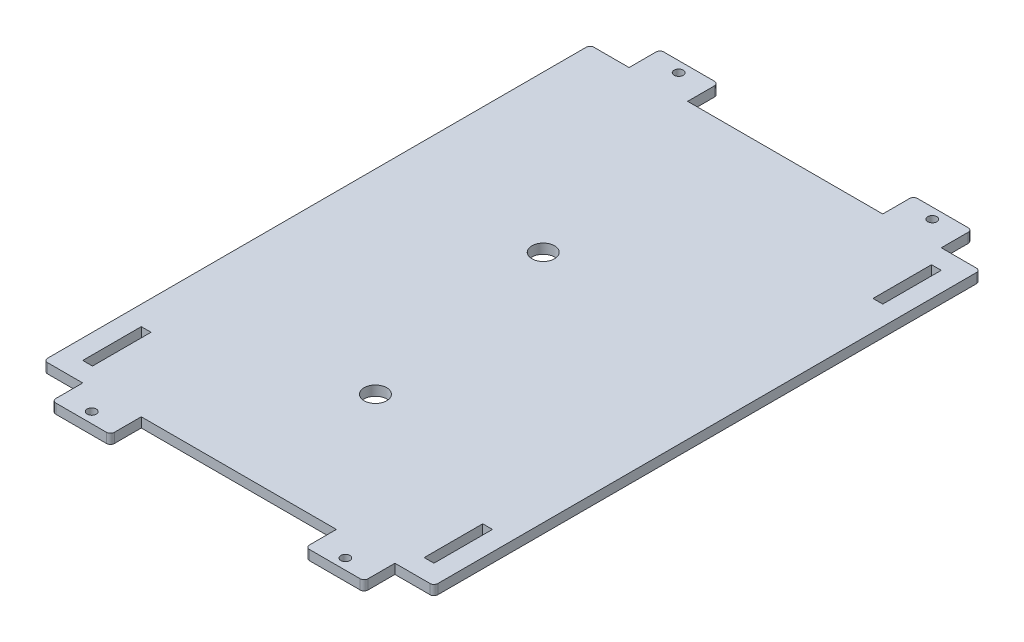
ISO-10303-21;
HEADER;
FILE_DESCRIPTION(('STEP AP214'),'2;1');
FILE_NAME('part.step','',(''),(''),'','','');
FILE_SCHEMA(('AUTOMOTIVE_DESIGN { 1 0 10303 214 1 1 1 1 }'));
ENDSEC;
DATA;
#1=APPLICATION_CONTEXT('core data for automotive mechanical design processes');
#2=APPLICATION_PROTOCOL_DEFINITION('international standard','automotive_design',2000,#1);
#3=PRODUCT_CONTEXT('',#1,'mechanical');
#4=PRODUCT('Part','Part','',(#3));
#5=PRODUCT_RELATED_PRODUCT_CATEGORY('part','',(#4));
#6=PRODUCT_DEFINITION_FORMATION('','',#4);
#7=PRODUCT_DEFINITION_CONTEXT('part definition',#1,'design');
#8=PRODUCT_DEFINITION('design','',#6,#7);
#9=PRODUCT_DEFINITION_SHAPE('','',#8);
#10=(LENGTH_UNIT() NAMED_UNIT(*) SI_UNIT(.MILLI.,.METRE.));
#11=(NAMED_UNIT(*) PLANE_ANGLE_UNIT() SI_UNIT($,.RADIAN.));
#12=(NAMED_UNIT(*) SI_UNIT($,.STERADIAN.) SOLID_ANGLE_UNIT());
#13=UNCERTAINTY_MEASURE_WITH_UNIT(LENGTH_MEASURE(1.E-05),#10,'distance_accuracy_value','');
#14=(GEOMETRIC_REPRESENTATION_CONTEXT(3) GLOBAL_UNCERTAINTY_ASSIGNED_CONTEXT((#13)) GLOBAL_UNIT_ASSIGNED_CONTEXT((#10,
#11,#12)) REPRESENTATION_CONTEXT('',''));
#15=CARTESIAN_POINT('',(0.,0.,0.));
#16=DIRECTION('',(0.,0.,1.));
#17=DIRECTION('',(1.,0.,0.));
#18=AXIS2_PLACEMENT_3D('',#15,#16,#17);
#19=CARTESIAN_POINT('',(0.,3.175,0.));
#20=DIRECTION('',(0.,0.,-1.));
#21=DIRECTION('',(-1.,0.,0.));
#22=AXIS2_PLACEMENT_3D('',#19,#20,#21);
#23=PLANE('',#22);
#24=DIRECTION('',(1.,0.,0.));
#25=VECTOR('',#24,1.);
#26=CARTESIAN_POINT('',(0.,3.175,0.));
#27=LINE('',#26,#25);
#28=CARTESIAN_POINT('',(1.27,3.175,0.));
#29=VERTEX_POINT('',#28);
#30=CARTESIAN_POINT('',(12.7,3.175,0.));
#31=VERTEX_POINT('',#30);
#32=EDGE_CURVE('E554',#29,#31,#27,.T.);
#33=ORIENTED_EDGE('',*,*,#32,.F.);
#34=DIRECTION('',(0.,-1.,0.));
#35=VECTOR('',#34,1.);
#36=CARTESIAN_POINT('',(1.27,3.175,0.));
#37=LINE('',#36,#35);
#38=CARTESIAN_POINT('',(1.27,0.,0.));
#39=VERTEX_POINT('',#38);
#40=EDGE_CURVE('E486',#29,#39,#37,.T.);
#41=ORIENTED_EDGE('',*,*,#40,.T.);
#42=DIRECTION('',(1.,0.,0.));
#43=VECTOR('',#42,1.);
#44=CARTESIAN_POINT('',(0.,0.,0.));
#45=LINE('',#44,#43);
#46=CARTESIAN_POINT('',(12.7,0.,0.));
#47=VERTEX_POINT('',#46);
#48=EDGE_CURVE('E549',#39,#47,#45,.T.);
#49=ORIENTED_EDGE('',*,*,#48,.T.);
#50=DIRECTION('',(0.,-1.,0.));
#51=VECTOR('',#50,1.);
#52=CARTESIAN_POINT('',(12.7,3.175,0.));
#53=LINE('',#52,#51);
#54=EDGE_CURVE('E447',#31,#47,#53,.T.);
#55=ORIENTED_EDGE('',*,*,#54,.F.);
#56=EDGE_LOOP('',(#33,#41,#49,#55));
#57=FACE_BOUND('',#56,.T.);
#58=ADVANCED_FACE('F33',(#57),#23,.F.);
#59=DIRECTION('',(0.,-1.,0.));
#60=VECTOR('',#59,1.);
#61=CARTESIAN_POINT('',(31.75,3.175,0.));
#62=LINE('',#61,#60);
#63=CARTESIAN_POINT('',(31.75,3.175,0.));
#64=VERTEX_POINT('',#63);
#65=CARTESIAN_POINT('',(31.75,0.,0.));
#66=VERTEX_POINT('',#65);
#67=EDGE_CURVE('E438',#64,#66,#62,.T.);
#68=ORIENTED_EDGE('',*,*,#67,.T.);
#69=CARTESIAN_POINT('',(95.25,0.,0.));
#70=VERTEX_POINT('',#69);
#71=EDGE_CURVE('E539',#66,#70,#45,.T.);
#72=ORIENTED_EDGE('',*,*,#71,.T.);
#73=DIRECTION('',(0.,-1.,0.));
#74=VECTOR('',#73,1.);
#75=CARTESIAN_POINT('',(95.25,3.175,0.));
#76=LINE('',#75,#74);
#77=CARTESIAN_POINT('',(95.25,3.175,0.));
#78=VERTEX_POINT('',#77);
#79=EDGE_CURVE('E469',#78,#70,#76,.T.);
#80=ORIENTED_EDGE('',*,*,#79,.F.);
#81=EDGE_CURVE('E552',#64,#78,#27,.T.);
#82=ORIENTED_EDGE('',*,*,#81,.F.);
#83=EDGE_LOOP('',(#68,#72,#80,#82));
#84=FACE_BOUND('',#83,.T.);
#85=ADVANCED_FACE('F769',(#84),#23,.F.);
#86=CARTESIAN_POINT('',(127.,3.175,-177.8));
#87=DIRECTION('',(0.,0.,1.));
#88=DIRECTION('',(1.,0.,0.));
#89=AXIS2_PLACEMENT_3D('',#86,#87,#88);
#90=PLANE('',#89);
#91=DIRECTION('',(-1.,0.,0.));
#92=VECTOR('',#91,1.);
#93=CARTESIAN_POINT('',(127.,3.175,-177.8));
#94=LINE('',#93,#92);
#95=CARTESIAN_POINT('',(125.73,3.175,-177.8));
#96=VERTEX_POINT('',#95);
#97=CARTESIAN_POINT('',(114.3,3.175,-177.8));
#98=VERTEX_POINT('',#97);
#99=EDGE_CURVE('E514',#96,#98,#94,.T.);
#100=ORIENTED_EDGE('',*,*,#99,.F.);
#101=DIRECTION('',(0.,-1.,0.));
#102=VECTOR('',#101,1.);
#103=CARTESIAN_POINT('',(125.73,3.175,-177.8));
#104=LINE('',#103,#102);
#105=CARTESIAN_POINT('',(125.73,0.,-177.8));
#106=VERTEX_POINT('',#105);
#107=EDGE_CURVE('E629',#96,#106,#104,.T.);
#108=ORIENTED_EDGE('',*,*,#107,.T.);
#109=DIRECTION('',(-1.,0.,0.));
#110=VECTOR('',#109,1.);
#111=CARTESIAN_POINT('',(127.,0.,-177.8));
#112=LINE('',#111,#110);
#113=CARTESIAN_POINT('',(114.3,0.,-177.8));
#114=VERTEX_POINT('',#113);
#115=EDGE_CURVE('E480',#106,#114,#112,.T.);
#116=ORIENTED_EDGE('',*,*,#115,.T.);
#117=DIRECTION('',(0.,-1.,0.));
#118=VECTOR('',#117,1.);
#119=CARTESIAN_POINT('',(114.3,3.175,-177.8));
#120=LINE('',#119,#118);
#121=EDGE_CURVE('E570',#98,#114,#120,.T.);
#122=ORIENTED_EDGE('',*,*,#121,.F.);
#123=EDGE_LOOP('',(#100,#108,#116,#122));
#124=FACE_BOUND('',#123,.T.);
#125=ADVANCED_FACE('F749',(#124),#90,.F.);
#126=DIRECTION('',(0.,-1.,0.));
#127=VECTOR('',#126,1.);
#128=CARTESIAN_POINT('',(95.25,3.175,-177.8));
#129=LINE('',#128,#127);
#130=CARTESIAN_POINT('',(95.25,3.175,-177.8));
#131=VERTEX_POINT('',#130);
#132=CARTESIAN_POINT('',(95.25,0.,-177.8));
#133=VERTEX_POINT('',#132);
#134=EDGE_CURVE('E714',#131,#133,#129,.T.);
#135=ORIENTED_EDGE('',*,*,#134,.T.);
#136=CARTESIAN_POINT('',(31.75,0.,-177.8));
#137=VERTEX_POINT('',#136);
#138=EDGE_CURVE('E535',#133,#137,#112,.T.);
#139=ORIENTED_EDGE('',*,*,#138,.T.);
#140=DIRECTION('',(0.,-1.,0.));
#141=VECTOR('',#140,1.);
#142=CARTESIAN_POINT('',(31.75,3.175,-177.8));
#143=LINE('',#142,#141);
#144=CARTESIAN_POINT('',(31.75,3.175,-177.8));
#145=VERTEX_POINT('',#144);
#146=EDGE_CURVE('E575',#145,#137,#143,.T.);
#147=ORIENTED_EDGE('',*,*,#146,.F.);
#148=EDGE_CURVE('E517',#131,#145,#94,.T.);
#149=ORIENTED_EDGE('',*,*,#148,.F.);
#150=EDGE_LOOP('',(#135,#139,#147,#149));
#151=FACE_BOUND('',#150,.T.);
#152=ADVANCED_FACE('F789',(#151),#90,.F.);
#153=CARTESIAN_POINT('',(0.,3.175,0.));
#154=DIRECTION('',(1.,0.,0.));
#155=DIRECTION('',(0.,0.,-1.));
#156=AXIS2_PLACEMENT_3D('',#153,#154,#155);
#157=PLANE('',#156);
#158=DIRECTION('',(0.,0.,1.));
#159=VECTOR('',#158,1.);
#160=CARTESIAN_POINT('',(0.,0.,0.));
#161=LINE('',#160,#159);
#162=CARTESIAN_POINT('',(0.,0.,-176.53));
#163=VERTEX_POINT('',#162);
#164=CARTESIAN_POINT('',(0.,0.,-1.27));
#165=VERTEX_POINT('',#164);
#166=EDGE_CURVE('E525',#163,#165,#161,.T.);
#167=ORIENTED_EDGE('',*,*,#166,.T.);
#168=DIRECTION('',(0.,-1.,0.));
#169=VECTOR('',#168,1.);
#170=CARTESIAN_POINT('',(0.,3.175,-1.27));
#171=LINE('',#170,#169);
#172=CARTESIAN_POINT('',(0.,3.175,-1.27));
#173=VERTEX_POINT('',#172);
#174=EDGE_CURVE('E511',#165,#173,#171,.F.);
#175=ORIENTED_EDGE('',*,*,#174,.T.);
#176=DIRECTION('',(0.,0.,1.));
#177=VECTOR('',#176,1.);
#178=CARTESIAN_POINT('',(0.,3.175,0.));
#179=LINE('',#178,#177);
#180=CARTESIAN_POINT('',(0.,3.175,-176.53));
#181=VERTEX_POINT('',#180);
#182=EDGE_CURVE('E558',#181,#173,#179,.T.);
#183=ORIENTED_EDGE('',*,*,#182,.F.);
#184=DIRECTION('',(0.,-1.,0.));
#185=VECTOR('',#184,1.);
#186=CARTESIAN_POINT('',(0.,3.175,-176.53));
#187=LINE('',#186,#185);
#188=EDGE_CURVE('E508',#181,#163,#187,.T.);
#189=ORIENTED_EDGE('',*,*,#188,.T.);
#190=EDGE_LOOP('',(#167,#175,#183,#189));
#191=FACE_BOUND('',#190,.T.);
#192=ADVANCED_FACE('F783',(#191),#157,.F.);
#193=CARTESIAN_POINT('',(114.3,0.,0.));
#194=VERTEX_POINT('',#193);
#195=CARTESIAN_POINT('',(125.73,0.,0.));
#196=VERTEX_POINT('',#195);
#197=EDGE_CURVE('E537',#194,#196,#45,.T.);
#198=ORIENTED_EDGE('',*,*,#197,.T.);
#199=DIRECTION('',(0.,-1.,0.));
#200=VECTOR('',#199,1.);
#201=CARTESIAN_POINT('',(125.73,3.175,0.));
#202=LINE('',#201,#200);
#203=CARTESIAN_POINT('',(125.73,3.175,0.));
#204=VERTEX_POINT('',#203);
#205=EDGE_CURVE('E670',#196,#204,#202,.F.);
#206=ORIENTED_EDGE('',*,*,#205,.T.);
#207=CARTESIAN_POINT('',(114.3,3.175,0.));
#208=VERTEX_POINT('',#207);
#209=EDGE_CURVE('E470',#208,#204,#27,.T.);
#210=ORIENTED_EDGE('',*,*,#209,.F.);
#211=DIRECTION('',(0.,-1.,0.));
#212=VECTOR('',#211,1.);
#213=CARTESIAN_POINT('',(114.3,3.175,0.));
#214=LINE('',#213,#212);
#215=EDGE_CURVE('E465',#208,#194,#214,.T.);
#216=ORIENTED_EDGE('',*,*,#215,.T.);
#217=EDGE_LOOP('',(#198,#206,#210,#216));
#218=FACE_BOUND('',#217,.T.);
#219=ADVANCED_FACE('F772',(#218),#23,.F.);
#220=CARTESIAN_POINT('',(127.,3.175,0.));
#221=DIRECTION('',(-1.,0.,0.));
#222=DIRECTION('',(0.,0.,1.));
#223=AXIS2_PLACEMENT_3D('',#220,#221,#222);
#224=PLANE('',#223);
#225=DIRECTION('',(0.,0.,-1.));
#226=VECTOR('',#225,1.);
#227=CARTESIAN_POINT('',(127.,3.175,0.));
#228=LINE('',#227,#226);
#229=CARTESIAN_POINT('',(127.,3.175,-1.27));
#230=VERTEX_POINT('',#229);
#231=CARTESIAN_POINT('',(127.,3.175,-176.53));
#232=VERTEX_POINT('',#231);
#233=EDGE_CURVE('E524',#230,#232,#228,.T.);
#234=ORIENTED_EDGE('',*,*,#233,.F.);
#235=DIRECTION('',(0.,-1.,0.));
#236=VECTOR('',#235,1.);
#237=CARTESIAN_POINT('',(127.,3.175,-1.27));
#238=LINE('',#237,#236);
#239=CARTESIAN_POINT('',(127.,0.,-1.27));
#240=VERTEX_POINT('',#239);
#241=EDGE_CURVE('E668',#230,#240,#238,.T.);
#242=ORIENTED_EDGE('',*,*,#241,.T.);
#243=DIRECTION('',(0.,0.,-1.));
#244=VECTOR('',#243,1.);
#245=CARTESIAN_POINT('',(127.,0.,0.));
#246=LINE('',#245,#244);
#247=CARTESIAN_POINT('',(127.,0.,-176.53));
#248=VERTEX_POINT('',#247);
#249=EDGE_CURVE('E542',#240,#248,#246,.T.);
#250=ORIENTED_EDGE('',*,*,#249,.T.);
#251=DIRECTION('',(0.,-1.,0.));
#252=VECTOR('',#251,1.);
#253=CARTESIAN_POINT('',(127.,3.175,-176.53));
#254=LINE('',#253,#252);
#255=EDGE_CURVE('E627',#248,#232,#254,.F.);
#256=ORIENTED_EDGE('',*,*,#255,.T.);
#257=EDGE_LOOP('',(#234,#242,#250,#256));
#258=FACE_BOUND('',#257,.T.);
#259=ADVANCED_FACE('F744',(#258),#224,.F.);
#260=CARTESIAN_POINT('',(12.7,0.,-177.8));
#261=VERTEX_POINT('',#260);
#262=CARTESIAN_POINT('',(1.26999999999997,0.,-177.8));
#263=VERTEX_POINT('',#262);
#264=EDGE_CURVE('E737',#261,#263,#112,.T.);
#265=ORIENTED_EDGE('',*,*,#264,.T.);
#266=DIRECTION('',(0.,-1.,0.));
#267=VECTOR('',#266,1.);
#268=CARTESIAN_POINT('',(1.26999999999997,3.175,-177.8));
#269=LINE('',#268,#267);
#270=CARTESIAN_POINT('',(1.26999999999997,3.175,-177.8));
#271=VERTEX_POINT('',#270);
#272=EDGE_CURVE('E48',#263,#271,#269,.F.);
#273=ORIENTED_EDGE('',*,*,#272,.T.);
#274=CARTESIAN_POINT('',(12.7,3.175,-177.8));
#275=VERTEX_POINT('',#274);
#276=EDGE_CURVE('E530',#275,#271,#94,.T.);
#277=ORIENTED_EDGE('',*,*,#276,.F.);
#278=DIRECTION('',(0.,-1.,0.));
#279=VECTOR('',#278,1.);
#280=CARTESIAN_POINT('',(12.7,3.175,-177.8));
#281=LINE('',#280,#279);
#282=EDGE_CURVE('E573',#275,#261,#281,.T.);
#283=ORIENTED_EDGE('',*,*,#282,.T.);
#284=EDGE_LOOP('',(#265,#273,#277,#283));
#285=FACE_BOUND('',#284,.T.);
#286=ADVANCED_FACE('F611',(#285),#90,.F.);
#287=CARTESIAN_POINT('',(0.,3.175,0.));
#288=DIRECTION('',(0.,1.,0.));
#289=DIRECTION('',(0.,0.,1.));
#290=AXIS2_PLACEMENT_3D('',#287,#288,#289);
#291=PLANE('',#290);
#292=CARTESIAN_POINT('',(22.225,3.175,-184.404));
#293=DIRECTION('',(0.,1.,0.));
#294=DIRECTION('',(0.,0.,1.));
#295=AXIS2_PLACEMENT_3D('',#292,#293,#294);
#296=CIRCLE('',#295,1.47319999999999);
#297=CARTESIAN_POINT('',(22.225,3.175,-182.9308));
#298=VERTEX_POINT('',#297);
#299=EDGE_CURVE('E1257',#298,#298,#296,.T.);
#300=ORIENTED_EDGE('',*,*,#299,.F.);
#301=EDGE_LOOP('',(#300));
#302=FACE_BOUND('',#301,.T.);
#303=CARTESIAN_POINT('',(104.775,3.175,-184.404));
#304=DIRECTION('',(0.,1.,0.));
#305=DIRECTION('',(0.,0.,1.));
#306=AXIS2_PLACEMENT_3D('',#303,#304,#305);
#307=CIRCLE('',#306,1.47319999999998);
#308=CARTESIAN_POINT('',(104.775,3.175,-182.9308));
#309=VERTEX_POINT('',#308);
#310=EDGE_CURVE('E1260',#309,#309,#307,.T.);
#311=ORIENTED_EDGE('',*,*,#310,.F.);
#312=EDGE_LOOP('',(#311));
#313=FACE_BOUND('',#312,.T.);
#314=CARTESIAN_POINT('',(22.225,3.175,6.60399999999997));
#315=DIRECTION('',(0.,1.,0.));
#316=DIRECTION('',(0.,0.,1.));
#317=AXIS2_PLACEMENT_3D('',#314,#315,#316);
#318=CIRCLE('',#317,1.47319999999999);
#319=CARTESIAN_POINT('',(22.225,3.175,8.07719999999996));
#320=VERTEX_POINT('',#319);
#321=EDGE_CURVE('E1266',#320,#320,#318,.T.);
#322=ORIENTED_EDGE('',*,*,#321,.F.);
#323=EDGE_LOOP('',(#322));
#324=FACE_BOUND('',#323,.T.);
#325=CARTESIAN_POINT('',(104.775,3.175,6.60399999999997));
#326=DIRECTION('',(0.,1.,0.));
#327=DIRECTION('',(0.,0.,1.));
#328=AXIS2_PLACEMENT_3D('',#325,#326,#327);
#329=CIRCLE('',#328,1.47319999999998);
#330=CARTESIAN_POINT('',(104.775,3.175,8.07719999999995));
#331=VERTEX_POINT('',#330);
#332=EDGE_CURVE('E1270',#331,#331,#329,.T.);
#333=ORIENTED_EDGE('',*,*,#332,.F.);
#334=EDGE_LOOP('',(#333));
#335=FACE_BOUND('',#334,.T.);
#336=CARTESIAN_POINT('',(63.5,3.175,-44.45));
#337=DIRECTION('',(0.,1.,0.));
#338=DIRECTION('',(0.,0.,1.));
#339=AXIS2_PLACEMENT_3D('',#336,#337,#338);
#340=CIRCLE('',#339,3.683);
#341=CARTESIAN_POINT('',(63.5,3.175,-40.767));
#342=VERTEX_POINT('',#341);
#343=EDGE_CURVE('E1273',#342,#342,#340,.T.);
#344=ORIENTED_EDGE('',*,*,#343,.F.);
#345=EDGE_LOOP('',(#344));
#346=FACE_BOUND('',#345,.T.);
#347=CARTESIAN_POINT('',(50.8,3.175,-111.76));
#348=DIRECTION('',(0.,1.,0.));
#349=DIRECTION('',(0.,0.,1.));
#350=AXIS2_PLACEMENT_3D('',#347,#348,#349);
#351=CIRCLE('',#350,3.683);
#352=CARTESIAN_POINT('',(50.8,3.175,-108.077));
#353=VERTEX_POINT('',#352);
#354=EDGE_CURVE('E348',#353,#353,#351,.T.);
#355=ORIENTED_EDGE('',*,*,#354,.F.);
#356=EDGE_LOOP('',(#355));
#357=FACE_BOUND('',#356,.T.);
#358=DIRECTION('',(0.,0.,-1.));
#359=VECTOR('',#358,1.);
#360=CARTESIAN_POINT('',(9.52500000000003,3.175,-6.35000000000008));
#361=LINE('',#360,#359);
#362=CARTESIAN_POINT('',(9.52500000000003,3.175,-6.35000000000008));
#363=VERTEX_POINT('',#362);
#364=CARTESIAN_POINT('',(9.52500000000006,3.175,-25.4000000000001));
#365=VERTEX_POINT('',#364);
#366=EDGE_CURVE('E324',#363,#365,#361,.T.);
#367=ORIENTED_EDGE('',*,*,#366,.F.);
#368=DIRECTION('',(1.,0.,0.));
#369=VECTOR('',#368,1.);
#370=CARTESIAN_POINT('',(9.52500000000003,3.175,-6.35000000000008));
#371=LINE('',#370,#369);
#372=CARTESIAN_POINT('',(6.35000000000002,3.175,-6.35000000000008));
#373=VERTEX_POINT('',#372);
#374=EDGE_CURVE('E342',#373,#363,#371,.T.);
#375=ORIENTED_EDGE('',*,*,#374,.F.);
#376=DIRECTION('',(0.,0.,1.));
#377=VECTOR('',#376,1.);
#378=CARTESIAN_POINT('',(6.35000000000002,3.175,-6.35000000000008));
#379=LINE('',#378,#377);
#380=CARTESIAN_POINT('',(6.35000000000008,3.175,-25.4000000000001));
#381=VERTEX_POINT('',#380);
#382=EDGE_CURVE('E345',#381,#373,#379,.T.);
#383=ORIENTED_EDGE('',*,*,#382,.F.);
#384=DIRECTION('',(-1.,0.,0.));
#385=VECTOR('',#384,1.);
#386=CARTESIAN_POINT('',(9.52500000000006,3.175,-25.4000000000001));
#387=LINE('',#386,#385);
#388=EDGE_CURVE('E354',#365,#381,#387,.T.);
#389=ORIENTED_EDGE('',*,*,#388,.F.);
#390=EDGE_LOOP('',(#367,#375,#383,#389));
#391=FACE_BOUND('',#390,.T.);
#392=DIRECTION('',(1.,0.,0.));
#393=VECTOR('',#392,1.);
#394=CARTESIAN_POINT('',(117.475,3.175,-6.35000000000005));
#395=LINE('',#394,#393);
#396=CARTESIAN_POINT('',(117.475,3.175,-6.35000000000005));
#397=VERTEX_POINT('',#396);
#398=CARTESIAN_POINT('',(120.65,3.175,-6.35000000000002));
#399=VERTEX_POINT('',#398);
#400=EDGE_CURVE('E361',#397,#399,#395,.T.);
#401=ORIENTED_EDGE('',*,*,#400,.F.);
#402=DIRECTION('',(0.,0.,1.));
#403=VECTOR('',#402,1.);
#404=CARTESIAN_POINT('',(117.475,3.175,-6.35000000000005));
#405=LINE('',#404,#403);
#406=CARTESIAN_POINT('',(117.475,3.175,-25.4));
#407=VERTEX_POINT('',#406);
#408=EDGE_CURVE('E369',#407,#397,#405,.T.);
#409=ORIENTED_EDGE('',*,*,#408,.F.);
#410=DIRECTION('',(-1.,0.,0.));
#411=VECTOR('',#410,1.);
#412=CARTESIAN_POINT('',(117.475,3.175,-25.4));
#413=LINE('',#412,#411);
#414=CARTESIAN_POINT('',(120.65,3.175,-25.4));
#415=VERTEX_POINT('',#414);
#416=EDGE_CURVE('E383',#415,#407,#413,.T.);
#417=ORIENTED_EDGE('',*,*,#416,.F.);
#418=DIRECTION('',(0.,0.,-1.));
#419=VECTOR('',#418,1.);
#420=CARTESIAN_POINT('',(120.65,3.175,-6.35000000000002));
#421=LINE('',#420,#419);
#422=EDGE_CURVE('E380',#399,#415,#421,.T.);
#423=ORIENTED_EDGE('',*,*,#422,.F.);
#424=EDGE_LOOP('',(#401,#409,#417,#423));
#425=FACE_BOUND('',#424,.T.);
#426=DIRECTION('',(0.,0.,1.));
#427=VECTOR('',#426,1.);
#428=CARTESIAN_POINT('',(117.475,3.175,-171.45));
#429=LINE('',#428,#427);
#430=CARTESIAN_POINT('',(117.475,3.175,-171.45));
#431=VERTEX_POINT('',#430);
#432=CARTESIAN_POINT('',(117.475,3.175,-152.4));
#433=VERTEX_POINT('',#432);
#434=EDGE_CURVE('E390',#431,#433,#429,.T.);
#435=ORIENTED_EDGE('',*,*,#434,.F.);
#436=DIRECTION('',(-1.,0.,0.));
#437=VECTOR('',#436,1.);
#438=CARTESIAN_POINT('',(117.475,3.175,-171.45));
#439=LINE('',#438,#437);
#440=CARTESIAN_POINT('',(120.65,3.175,-171.45));
#441=VERTEX_POINT('',#440);
#442=EDGE_CURVE('E401',#441,#431,#439,.T.);
#443=ORIENTED_EDGE('',*,*,#442,.F.);
#444=DIRECTION('',(0.,0.,-1.));
#445=VECTOR('',#444,1.);
#446=CARTESIAN_POINT('',(120.65,3.175,-171.45));
#447=LINE('',#446,#445);
#448=CARTESIAN_POINT('',(120.65,3.175,-152.4));
#449=VERTEX_POINT('',#448);
#450=EDGE_CURVE('E415',#449,#441,#447,.T.);
#451=ORIENTED_EDGE('',*,*,#450,.F.);
#452=DIRECTION('',(1.,0.,0.));
#453=VECTOR('',#452,1.);
#454=CARTESIAN_POINT('',(117.475,3.175,-152.4));
#455=LINE('',#454,#453);
#456=EDGE_CURVE('E412',#433,#449,#455,.T.);
#457=ORIENTED_EDGE('',*,*,#456,.F.);
#458=EDGE_LOOP('',(#435,#443,#451,#457));
#459=FACE_BOUND('',#458,.T.);
#460=ORIENTED_EDGE('',*,*,#182,.T.);
#461=CARTESIAN_POINT('',(1.27,3.175,-1.27));
#462=DIRECTION('',(0.,1.,0.));
#463=DIRECTION('',(0.,0.,1.));
#464=AXIS2_PLACEMENT_3D('',#461,#462,#463);
#465=CIRCLE('',#464,1.27);
#466=EDGE_CURVE('E645',#173,#29,#465,.T.);
#467=ORIENTED_EDGE('',*,*,#466,.T.);
#468=ORIENTED_EDGE('',*,*,#32,.T.);
#469=DIRECTION('',(0.,0.,1.));
#470=VECTOR('',#469,1.);
#471=CARTESIAN_POINT('',(12.7,3.175,0.));
#472=LINE('',#471,#470);
#473=CARTESIAN_POINT('',(12.7,3.175,8.76299999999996));
#474=VERTEX_POINT('',#473);
#475=EDGE_CURVE('E429',#31,#474,#472,.T.);
#476=ORIENTED_EDGE('',*,*,#475,.T.);
#477=CARTESIAN_POINT('',(13.97,3.175,8.76299999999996));
#478=DIRECTION('',(0.,1.,0.));
#479=DIRECTION('',(0.,0.,1.));
#480=AXIS2_PLACEMENT_3D('',#477,#478,#479);
#481=CIRCLE('',#480,1.27);
#482=CARTESIAN_POINT('',(13.97,3.175,10.033));
#483=VERTEX_POINT('',#482);
#484=EDGE_CURVE('E643',#474,#483,#481,.T.);
#485=ORIENTED_EDGE('',*,*,#484,.T.);
#486=DIRECTION('',(1.,0.,0.));
#487=VECTOR('',#486,1.);
#488=CARTESIAN_POINT('',(12.7,3.175,10.033));
#489=LINE('',#488,#487);
#490=CARTESIAN_POINT('',(30.48,3.175,10.033));
#491=VERTEX_POINT('',#490);
#492=EDGE_CURVE('E432',#483,#491,#489,.T.);
#493=ORIENTED_EDGE('',*,*,#492,.T.);
#494=CARTESIAN_POINT('',(30.48,3.175,8.76299999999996));
#495=DIRECTION('',(0.,1.,0.));
#496=DIRECTION('',(0.,0.,1.));
#497=AXIS2_PLACEMENT_3D('',#494,#495,#496);
#498=CIRCLE('',#497,1.27);
#499=CARTESIAN_POINT('',(31.75,3.175,8.76299999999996));
#500=VERTEX_POINT('',#499);
#501=EDGE_CURVE('E641',#491,#500,#498,.T.);
#502=ORIENTED_EDGE('',*,*,#501,.T.);
#503=DIRECTION('',(0.,0.,-1.));
#504=VECTOR('',#503,1.);
#505=CARTESIAN_POINT('',(31.75,3.175,0.));
#506=LINE('',#505,#504);
#507=EDGE_CURVE('E436',#500,#64,#506,.T.);
#508=ORIENTED_EDGE('',*,*,#507,.T.);
#509=ORIENTED_EDGE('',*,*,#81,.T.);
#510=DIRECTION('',(0.,0.,1.));
#511=VECTOR('',#510,1.);
#512=CARTESIAN_POINT('',(95.25,3.175,0.));
#513=LINE('',#512,#511);
#514=CARTESIAN_POINT('',(95.25,3.175,8.76299999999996));
#515=VERTEX_POINT('',#514);
#516=EDGE_CURVE('E455',#78,#515,#513,.T.);
#517=ORIENTED_EDGE('',*,*,#516,.T.);
#518=CARTESIAN_POINT('',(96.52,3.175,8.76299999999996));
#519=DIRECTION('',(0.,1.,0.));
#520=DIRECTION('',(0.,0.,1.));
#521=AXIS2_PLACEMENT_3D('',#518,#519,#520);
#522=CIRCLE('',#521,1.27);
#523=CARTESIAN_POINT('',(96.52,3.175,10.033));
#524=VERTEX_POINT('',#523);
#525=EDGE_CURVE('E639',#515,#524,#522,.T.);
#526=ORIENTED_EDGE('',*,*,#525,.T.);
#527=DIRECTION('',(1.,0.,0.));
#528=VECTOR('',#527,1.);
#529=CARTESIAN_POINT('',(114.3,3.175,10.033));
#530=LINE('',#529,#528);
#531=CARTESIAN_POINT('',(113.03,3.175,10.033));
#532=VERTEX_POINT('',#531);
#533=EDGE_CURVE('E451',#524,#532,#530,.T.);
#534=ORIENTED_EDGE('',*,*,#533,.T.);
#535=CARTESIAN_POINT('',(113.03,3.175,8.76299999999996));
#536=DIRECTION('',(0.,1.,0.));
#537=DIRECTION('',(0.,0.,1.));
#538=AXIS2_PLACEMENT_3D('',#535,#536,#537);
#539=CIRCLE('',#538,1.27);
#540=CARTESIAN_POINT('',(114.3,3.175,8.76299999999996));
#541=VERTEX_POINT('',#540);
#542=EDGE_CURVE('E632',#532,#541,#539,.T.);
#543=ORIENTED_EDGE('',*,*,#542,.T.);
#544=DIRECTION('',(0.,0.,-1.));
#545=VECTOR('',#544,1.);
#546=CARTESIAN_POINT('',(114.3,3.175,0.));
#547=LINE('',#546,#545);
#548=EDGE_CURVE('E454',#541,#208,#547,.T.);
#549=ORIENTED_EDGE('',*,*,#548,.T.);
#550=ORIENTED_EDGE('',*,*,#209,.T.);
#551=CARTESIAN_POINT('',(125.73,3.175,-1.27));
#552=DIRECTION('',(0.,1.,0.));
#553=DIRECTION('',(0.,0.,1.));
#554=AXIS2_PLACEMENT_3D('',#551,#552,#553);
#555=CIRCLE('',#554,1.27);
#556=EDGE_CURVE('E619',#204,#230,#555,.T.);
#557=ORIENTED_EDGE('',*,*,#556,.T.);
#558=ORIENTED_EDGE('',*,*,#233,.T.);
#559=CARTESIAN_POINT('',(125.73,3.175,-176.53));
#560=DIRECTION('',(0.,1.,0.));
#561=DIRECTION('',(0.,0.,1.));
#562=AXIS2_PLACEMENT_3D('',#559,#560,#561);
#563=CIRCLE('',#562,1.27);
#564=EDGE_CURVE('E615',#232,#96,#563,.T.);
#565=ORIENTED_EDGE('',*,*,#564,.T.);
#566=ORIENTED_EDGE('',*,*,#99,.T.);
#567=DIRECTION('',(0.,0.,-1.));
#568=VECTOR('',#567,1.);
#569=CARTESIAN_POINT('',(114.3,3.175,-177.8));
#570=LINE('',#569,#568);
#571=CARTESIAN_POINT('',(114.3,3.175,-186.563));
#572=VERTEX_POINT('',#571);
#573=EDGE_CURVE('E729',#98,#572,#570,.T.);
#574=ORIENTED_EDGE('',*,*,#573,.T.);
#575=CARTESIAN_POINT('',(113.03,3.175,-186.563));
#576=DIRECTION('',(0.,1.,0.));
#577=DIRECTION('',(0.,0.,1.));
#578=AXIS2_PLACEMENT_3D('',#575,#576,#577);
#579=CIRCLE('',#578,1.27);
#580=CARTESIAN_POINT('',(113.03,3.175,-187.833));
#581=VERTEX_POINT('',#580);
#582=EDGE_CURVE('E630',#572,#581,#579,.T.);
#583=ORIENTED_EDGE('',*,*,#582,.T.);
#584=DIRECTION('',(-1.,0.,0.));
#585=VECTOR('',#584,1.);
#586=CARTESIAN_POINT('',(114.3,3.175,-187.833));
#587=LINE('',#586,#585);
#588=CARTESIAN_POINT('',(96.52,3.175,-187.833));
#589=VERTEX_POINT('',#588);
#590=EDGE_CURVE('E705',#581,#589,#587,.T.);
#591=ORIENTED_EDGE('',*,*,#590,.T.);
#592=CARTESIAN_POINT('',(96.52,3.175,-186.563));
#593=DIRECTION('',(0.,1.,0.));
#594=DIRECTION('',(0.,0.,1.));
#595=AXIS2_PLACEMENT_3D('',#592,#593,#594);
#596=CIRCLE('',#595,1.27);
#597=CARTESIAN_POINT('',(95.25,3.175,-186.563));
#598=VERTEX_POINT('',#597);
#599=EDGE_CURVE('E634',#589,#598,#596,.T.);
#600=ORIENTED_EDGE('',*,*,#599,.T.);
#601=DIRECTION('',(0.,0.,1.));
#602=VECTOR('',#601,1.);
#603=CARTESIAN_POINT('',(95.25,3.175,-177.8));
#604=LINE('',#603,#602);
#605=EDGE_CURVE('E703',#598,#131,#604,.T.);
#606=ORIENTED_EDGE('',*,*,#605,.T.);
#607=ORIENTED_EDGE('',*,*,#148,.T.);
#608=DIRECTION('',(0.,0.,-1.));
#609=VECTOR('',#608,1.);
#610=CARTESIAN_POINT('',(31.75,3.175,-177.8));
#611=LINE('',#610,#609);
#612=CARTESIAN_POINT('',(31.75,3.175,-186.563));
#613=VERTEX_POINT('',#612);
#614=EDGE_CURVE('E587',#145,#613,#611,.T.);
#615=ORIENTED_EDGE('',*,*,#614,.T.);
#616=CARTESIAN_POINT('',(30.48,3.175,-186.563));
#617=DIRECTION('',(0.,1.,0.));
#618=DIRECTION('',(0.,0.,1.));
#619=AXIS2_PLACEMENT_3D('',#616,#617,#618);
#620=CIRCLE('',#619,1.27);
#621=CARTESIAN_POINT('',(30.48,3.175,-187.833));
#622=VERTEX_POINT('',#621);
#623=EDGE_CURVE('E692',#613,#622,#620,.T.);
#624=ORIENTED_EDGE('',*,*,#623,.T.);
#625=DIRECTION('',(-1.,0.,0.));
#626=VECTOR('',#625,1.);
#627=CARTESIAN_POINT('',(12.7,3.175,-187.833));
#628=LINE('',#627,#626);
#629=CARTESIAN_POINT('',(13.97,3.175,-187.833));
#630=VERTEX_POINT('',#629);
#631=EDGE_CURVE('E586',#622,#630,#628,.T.);
#632=ORIENTED_EDGE('',*,*,#631,.T.);
#633=CARTESIAN_POINT('',(13.97,3.175,-186.563));
#634=DIRECTION('',(0.,1.,0.));
#635=DIRECTION('',(0.,0.,1.));
#636=AXIS2_PLACEMENT_3D('',#633,#634,#635);
#637=CIRCLE('',#636,1.27);
#638=CARTESIAN_POINT('',(12.7,3.175,-186.563));
#639=VERTEX_POINT('',#638);
#640=EDGE_CURVE('E56',#630,#639,#637,.T.);
#641=ORIENTED_EDGE('',*,*,#640,.T.);
#642=DIRECTION('',(0.,0.,1.));
#643=VECTOR('',#642,1.);
#644=CARTESIAN_POINT('',(12.7,3.175,-177.8));
#645=LINE('',#644,#643);
#646=EDGE_CURVE('E518',#639,#275,#645,.T.);
#647=ORIENTED_EDGE('',*,*,#646,.T.);
#648=ORIENTED_EDGE('',*,*,#276,.T.);
#649=CARTESIAN_POINT('',(1.26999999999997,3.175,-176.53));
#650=DIRECTION('',(0.,1.,0.));
#651=DIRECTION('',(0.,0.,1.));
#652=AXIS2_PLACEMENT_3D('',#649,#650,#651);
#653=CIRCLE('',#652,1.27);
#654=EDGE_CURVE('E697',#271,#181,#653,.T.);
#655=ORIENTED_EDGE('',*,*,#654,.T.);
#656=EDGE_LOOP('',(#460,#467,#468,#476,#485,#493,#502,#508,#509,#517,#526,#534,#543,#549,#550,
#557,#558,#565,#566,#574,#583,#591,#600,#606,#607,#615,#624,#632,#641,#647,#648,#655));
#657=FACE_BOUND('',#656,.T.);
#658=ADVANCED_FACE('F604',(#302,#313,#324,#335,#346,#357,#391,#425,#459,#657),#291,.T.);
#659=CARTESIAN_POINT('',(0.,0.,0.));
#660=DIRECTION('',(0.,1.,0.));
#661=DIRECTION('',(0.,0.,1.));
#662=AXIS2_PLACEMENT_3D('',#659,#660,#661);
#663=PLANE('',#662);
#664=CARTESIAN_POINT('',(22.225,0.,-184.404));
#665=DIRECTION('',(0.,1.,0.));
#666=DIRECTION('',(0.,0.,1.));
#667=AXIS2_PLACEMENT_3D('',#664,#665,#666);
#668=CIRCLE('',#667,1.47319999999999);
#669=CARTESIAN_POINT('',(22.225,0.,-182.9308));
#670=VERTEX_POINT('',#669);
#671=EDGE_CURVE('E564',#670,#670,#668,.T.);
#672=ORIENTED_EDGE('',*,*,#671,.T.);
#673=EDGE_LOOP('',(#672));
#674=FACE_BOUND('',#673,.T.);
#675=CARTESIAN_POINT('',(104.775,0.,-184.404));
#676=DIRECTION('',(0.,1.,0.));
#677=DIRECTION('',(0.,0.,1.));
#678=AXIS2_PLACEMENT_3D('',#675,#676,#677);
#679=CIRCLE('',#678,1.47319999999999);
#680=CARTESIAN_POINT('',(104.775,0.,-182.9308));
#681=VERTEX_POINT('',#680);
#682=EDGE_CURVE('E1262',#681,#681,#679,.T.);
#683=ORIENTED_EDGE('',*,*,#682,.T.);
#684=EDGE_LOOP('',(#683));
#685=FACE_BOUND('',#684,.T.);
#686=CARTESIAN_POINT('',(22.225,0.,6.60399999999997));
#687=DIRECTION('',(0.,1.,0.));
#688=DIRECTION('',(0.,0.,1.));
#689=AXIS2_PLACEMENT_3D('',#686,#687,#688);
#690=CIRCLE('',#689,1.47319999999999);
#691=CARTESIAN_POINT('',(22.225,0.,8.07719999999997));
#692=VERTEX_POINT('',#691);
#693=EDGE_CURVE('E1269',#692,#692,#690,.T.);
#694=ORIENTED_EDGE('',*,*,#693,.T.);
#695=EDGE_LOOP('',(#694));
#696=FACE_BOUND('',#695,.T.);
#697=CARTESIAN_POINT('',(104.775,0.,6.60399999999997));
#698=DIRECTION('',(0.,1.,0.));
#699=DIRECTION('',(0.,0.,1.));
#700=AXIS2_PLACEMENT_3D('',#697,#698,#699);
#701=CIRCLE('',#700,1.47319999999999);
#702=CARTESIAN_POINT('',(104.775,0.,8.07719999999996));
#703=VERTEX_POINT('',#702);
#704=EDGE_CURVE('E1272',#703,#703,#701,.T.);
#705=ORIENTED_EDGE('',*,*,#704,.T.);
#706=EDGE_LOOP('',(#705));
#707=FACE_BOUND('',#706,.T.);
#708=CARTESIAN_POINT('',(63.5,0.,-44.45));
#709=DIRECTION('',(0.,1.,0.));
#710=DIRECTION('',(0.,0.,1.));
#711=AXIS2_PLACEMENT_3D('',#708,#709,#710);
#712=CIRCLE('',#711,3.683);
#713=CARTESIAN_POINT('',(63.5,0.,-40.767));
#714=VERTEX_POINT('',#713);
#715=EDGE_CURVE('E1275',#714,#714,#712,.T.);
#716=ORIENTED_EDGE('',*,*,#715,.T.);
#717=EDGE_LOOP('',(#716));
#718=FACE_BOUND('',#717,.T.);
#719=CARTESIAN_POINT('',(50.8,0.,-111.76));
#720=DIRECTION('',(0.,1.,0.));
#721=DIRECTION('',(0.,0.,1.));
#722=AXIS2_PLACEMENT_3D('',#719,#720,#721);
#723=CIRCLE('',#722,3.683);
#724=CARTESIAN_POINT('',(50.8,0.,-108.077));
#725=VERTEX_POINT('',#724);
#726=EDGE_CURVE('E355',#725,#725,#723,.T.);
#727=ORIENTED_EDGE('',*,*,#726,.T.);
#728=EDGE_LOOP('',(#727));
#729=FACE_BOUND('',#728,.T.);
#730=DIRECTION('',(1.,0.,0.));
#731=VECTOR('',#730,1.);
#732=CARTESIAN_POINT('',(9.52500000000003,0.,-6.35000000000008));
#733=LINE('',#732,#731);
#734=CARTESIAN_POINT('',(6.35000000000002,0.,-6.35000000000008));
#735=VERTEX_POINT('',#734);
#736=CARTESIAN_POINT('',(9.52500000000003,0.,-6.35000000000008));
#737=VERTEX_POINT('',#736);
#738=EDGE_CURVE('E329',#735,#737,#733,.T.);
#739=ORIENTED_EDGE('',*,*,#738,.T.);
#740=DIRECTION('',(0.,0.,-1.));
#741=VECTOR('',#740,1.);
#742=CARTESIAN_POINT('',(9.52500000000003,0.,-6.35000000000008));
#743=LINE('',#742,#741);
#744=CARTESIAN_POINT('',(9.52500000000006,0.,-25.4000000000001));
#745=VERTEX_POINT('',#744);
#746=EDGE_CURVE('E321',#737,#745,#743,.T.);
#747=ORIENTED_EDGE('',*,*,#746,.T.);
#748=DIRECTION('',(-1.,0.,0.));
#749=VECTOR('',#748,1.);
#750=CARTESIAN_POINT('',(9.52500000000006,0.,-25.4000000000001));
#751=LINE('',#750,#749);
#752=CARTESIAN_POINT('',(6.35000000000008,0.,-25.4000000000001));
#753=VERTEX_POINT('',#752);
#754=EDGE_CURVE('E333',#745,#753,#751,.T.);
#755=ORIENTED_EDGE('',*,*,#754,.T.);
#756=DIRECTION('',(0.,0.,1.));
#757=VECTOR('',#756,1.);
#758=CARTESIAN_POINT('',(6.35000000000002,0.,-6.35000000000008));
#759=LINE('',#758,#757);
#760=EDGE_CURVE('E337',#753,#735,#759,.T.);
#761=ORIENTED_EDGE('',*,*,#760,.T.);
#762=EDGE_LOOP('',(#739,#747,#755,#761));
#763=FACE_BOUND('',#762,.T.);
#764=DIRECTION('',(0.,0.,1.));
#765=VECTOR('',#764,1.);
#766=CARTESIAN_POINT('',(117.475,0.,-6.35000000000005));
#767=LINE('',#766,#765);
#768=CARTESIAN_POINT('',(117.475,0.,-25.4));
#769=VERTEX_POINT('',#768);
#770=CARTESIAN_POINT('',(117.475,0.,-6.35000000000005));
#771=VERTEX_POINT('',#770);
#772=EDGE_CURVE('E375',#769,#771,#767,.T.);
#773=ORIENTED_EDGE('',*,*,#772,.T.);
#774=DIRECTION('',(1.,0.,0.));
#775=VECTOR('',#774,1.);
#776=CARTESIAN_POINT('',(117.475,0.,-6.35000000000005));
#777=LINE('',#776,#775);
#778=CARTESIAN_POINT('',(120.65,0.,-6.35000000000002));
#779=VERTEX_POINT('',#778);
#780=EDGE_CURVE('E365',#771,#779,#777,.T.);
#781=ORIENTED_EDGE('',*,*,#780,.T.);
#782=DIRECTION('',(0.,0.,-1.));
#783=VECTOR('',#782,1.);
#784=CARTESIAN_POINT('',(120.65,0.,-6.35000000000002));
#785=LINE('',#784,#783);
#786=CARTESIAN_POINT('',(120.65,0.,-25.4));
#787=VERTEX_POINT('',#786);
#788=EDGE_CURVE('E368',#779,#787,#785,.T.);
#789=ORIENTED_EDGE('',*,*,#788,.T.);
#790=DIRECTION('',(-1.,0.,0.));
#791=VECTOR('',#790,1.);
#792=CARTESIAN_POINT('',(117.475,0.,-25.4));
#793=LINE('',#792,#791);
#794=EDGE_CURVE('E372',#787,#769,#793,.T.);
#795=ORIENTED_EDGE('',*,*,#794,.T.);
#796=EDGE_LOOP('',(#773,#781,#789,#795));
#797=FACE_BOUND('',#796,.T.);
#798=DIRECTION('',(-1.,0.,0.));
#799=VECTOR('',#798,1.);
#800=CARTESIAN_POINT('',(117.475,0.,-171.45));
#801=LINE('',#800,#799);
#802=CARTESIAN_POINT('',(120.65,0.,-171.45));
#803=VERTEX_POINT('',#802);
#804=CARTESIAN_POINT('',(117.475,0.,-171.45));
#805=VERTEX_POINT('',#804);
#806=EDGE_CURVE('E407',#803,#805,#801,.T.);
#807=ORIENTED_EDGE('',*,*,#806,.T.);
#808=DIRECTION('',(0.,0.,1.));
#809=VECTOR('',#808,1.);
#810=CARTESIAN_POINT('',(117.475,0.,-171.45));
#811=LINE('',#810,#809);
#812=CARTESIAN_POINT('',(117.475,0.,-152.4));
#813=VERTEX_POINT('',#812);
#814=EDGE_CURVE('E397',#805,#813,#811,.T.);
#815=ORIENTED_EDGE('',*,*,#814,.T.);
#816=DIRECTION('',(1.,0.,0.));
#817=VECTOR('',#816,1.);
#818=CARTESIAN_POINT('',(117.475,0.,-152.4));
#819=LINE('',#818,#817);
#820=CARTESIAN_POINT('',(120.65,0.,-152.4));
#821=VERTEX_POINT('',#820);
#822=EDGE_CURVE('E400',#813,#821,#819,.T.);
#823=ORIENTED_EDGE('',*,*,#822,.T.);
#824=DIRECTION('',(0.,0.,-1.));
#825=VECTOR('',#824,1.);
#826=CARTESIAN_POINT('',(120.65,0.,-171.45));
#827=LINE('',#826,#825);
#828=EDGE_CURVE('E404',#821,#803,#827,.T.);
#829=ORIENTED_EDGE('',*,*,#828,.T.);
#830=EDGE_LOOP('',(#807,#815,#823,#829));
#831=FACE_BOUND('',#830,.T.);
#832=ORIENTED_EDGE('',*,*,#48,.F.);
#833=CARTESIAN_POINT('',(1.27,0.,-1.27));
#834=DIRECTION('',(0.,1.,0.));
#835=DIRECTION('',(0.,0.,1.));
#836=AXIS2_PLACEMENT_3D('',#833,#834,#835);
#837=CIRCLE('',#836,1.27);
#838=EDGE_CURVE('E506',#39,#165,#837,.F.);
#839=ORIENTED_EDGE('',*,*,#838,.T.);
#840=ORIENTED_EDGE('',*,*,#166,.F.);
#841=CARTESIAN_POINT('',(1.26999999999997,0.,-176.53));
#842=DIRECTION('',(0.,1.,0.));
#843=DIRECTION('',(0.,0.,1.));
#844=AXIS2_PLACEMENT_3D('',#841,#842,#843);
#845=CIRCLE('',#844,1.27);
#846=EDGE_CURVE('E488',#163,#263,#845,.F.);
#847=ORIENTED_EDGE('',*,*,#846,.T.);
#848=ORIENTED_EDGE('',*,*,#264,.F.);
#849=DIRECTION('',(0.,0.,1.));
#850=VECTOR('',#849,1.);
#851=CARTESIAN_POINT('',(12.7,0.,-177.8));
#852=LINE('',#851,#850);
#853=CARTESIAN_POINT('',(12.7,0.,-186.563));
#854=VERTEX_POINT('',#853);
#855=EDGE_CURVE('E568',#854,#261,#852,.T.);
#856=ORIENTED_EDGE('',*,*,#855,.F.);
#857=CARTESIAN_POINT('',(13.97,0.,-186.563));
#858=DIRECTION('',(0.,1.,0.));
#859=DIRECTION('',(0.,0.,1.));
#860=AXIS2_PLACEMENT_3D('',#857,#858,#859);
#861=CIRCLE('',#860,1.27);
#862=CARTESIAN_POINT('',(13.97,0.,-187.833));
#863=VERTEX_POINT('',#862);
#864=EDGE_CURVE('E483',#854,#863,#861,.F.);
#865=ORIENTED_EDGE('',*,*,#864,.T.);
#866=DIRECTION('',(-1.,0.,0.));
#867=VECTOR('',#866,1.);
#868=CARTESIAN_POINT('',(12.7,0.,-187.833));
#869=LINE('',#868,#867);
#870=CARTESIAN_POINT('',(30.48,0.,-187.833));
#871=VERTEX_POINT('',#870);
#872=EDGE_CURVE('E582',#871,#863,#869,.T.);
#873=ORIENTED_EDGE('',*,*,#872,.F.);
#874=CARTESIAN_POINT('',(30.48,0.,-186.563));
#875=DIRECTION('',(0.,1.,0.));
#876=DIRECTION('',(0.,0.,1.));
#877=AXIS2_PLACEMENT_3D('',#874,#875,#876);
#878=CIRCLE('',#877,1.27);
#879=CARTESIAN_POINT('',(31.75,0.,-186.563));
#880=VERTEX_POINT('',#879);
#881=EDGE_CURVE('E485',#871,#880,#878,.F.);
#882=ORIENTED_EDGE('',*,*,#881,.T.);
#883=DIRECTION('',(0.,0.,-1.));
#884=VECTOR('',#883,1.);
#885=CARTESIAN_POINT('',(31.75,0.,-177.8));
#886=LINE('',#885,#884);
#887=EDGE_CURVE('E569',#137,#880,#886,.T.);
#888=ORIENTED_EDGE('',*,*,#887,.F.);
#889=ORIENTED_EDGE('',*,*,#138,.F.);
#890=DIRECTION('',(0.,0.,1.));
#891=VECTOR('',#890,1.);
#892=CARTESIAN_POINT('',(95.25,0.,-177.8));
#893=LINE('',#892,#891);
#894=CARTESIAN_POINT('',(95.25,0.,-186.563));
#895=VERTEX_POINT('',#894);
#896=EDGE_CURVE('E723',#895,#133,#893,.T.);
#897=ORIENTED_EDGE('',*,*,#896,.F.);
#898=CARTESIAN_POINT('',(96.52,0.,-186.563));
#899=DIRECTION('',(0.,1.,0.));
#900=DIRECTION('',(0.,0.,1.));
#901=AXIS2_PLACEMENT_3D('',#898,#899,#900);
#902=CIRCLE('',#901,1.27);
#903=CARTESIAN_POINT('',(96.52,0.,-187.833));
#904=VERTEX_POINT('',#903);
#905=EDGE_CURVE('E490',#895,#904,#902,.F.);
#906=ORIENTED_EDGE('',*,*,#905,.T.);
#907=DIRECTION('',(-1.,0.,0.));
#908=VECTOR('',#907,1.);
#909=CARTESIAN_POINT('',(114.3,0.,-187.833));
#910=LINE('',#909,#908);
#911=CARTESIAN_POINT('',(113.03,0.,-187.833));
#912=VERTEX_POINT('',#911);
#913=EDGE_CURVE('E721',#912,#904,#910,.T.);
#914=ORIENTED_EDGE('',*,*,#913,.F.);
#915=CARTESIAN_POINT('',(113.03,0.,-186.563));
#916=DIRECTION('',(0.,1.,0.));
#917=DIRECTION('',(0.,0.,1.));
#918=AXIS2_PLACEMENT_3D('',#915,#916,#917);
#919=CIRCLE('',#918,1.27);
#920=CARTESIAN_POINT('',(114.3,0.,-186.563));
#921=VERTEX_POINT('',#920);
#922=EDGE_CURVE('E492',#912,#921,#919,.F.);
#923=ORIENTED_EDGE('',*,*,#922,.T.);
#924=DIRECTION('',(0.,0.,-1.));
#925=VECTOR('',#924,1.);
#926=CARTESIAN_POINT('',(114.3,0.,-177.8));
#927=LINE('',#926,#925);
#928=EDGE_CURVE('E727',#114,#921,#927,.T.);
#929=ORIENTED_EDGE('',*,*,#928,.F.);
#930=ORIENTED_EDGE('',*,*,#115,.F.);
#931=CARTESIAN_POINT('',(125.73,0.,-176.53));
#932=DIRECTION('',(0.,1.,0.));
#933=DIRECTION('',(0.,0.,1.));
#934=AXIS2_PLACEMENT_3D('',#931,#932,#933);
#935=CIRCLE('',#934,1.27);
#936=EDGE_CURVE('E494',#106,#248,#935,.F.);
#937=ORIENTED_EDGE('',*,*,#936,.T.);
#938=ORIENTED_EDGE('',*,*,#249,.F.);
#939=CARTESIAN_POINT('',(125.73,0.,-1.27));
#940=DIRECTION('',(0.,1.,0.));
#941=DIRECTION('',(0.,0.,1.));
#942=AXIS2_PLACEMENT_3D('',#939,#940,#941);
#943=CIRCLE('',#942,1.27);
#944=EDGE_CURVE('E496',#240,#196,#943,.F.);
#945=ORIENTED_EDGE('',*,*,#944,.T.);
#946=ORIENTED_EDGE('',*,*,#197,.F.);
#947=DIRECTION('',(0.,0.,-1.));
#948=VECTOR('',#947,1.);
#949=CARTESIAN_POINT('',(114.3,0.,0.));
#950=LINE('',#949,#948);
#951=CARTESIAN_POINT('',(114.3,0.,8.76299999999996));
#952=VERTEX_POINT('',#951);
#953=EDGE_CURVE('E459',#952,#194,#950,.T.);
#954=ORIENTED_EDGE('',*,*,#953,.F.);
#955=CARTESIAN_POINT('',(113.03,0.,8.76299999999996));
#956=DIRECTION('',(0.,1.,0.));
#957=DIRECTION('',(0.,0.,1.));
#958=AXIS2_PLACEMENT_3D('',#955,#956,#957);
#959=CIRCLE('',#958,1.27);
#960=CARTESIAN_POINT('',(113.03,0.,10.033));
#961=VERTEX_POINT('',#960);
#962=EDGE_CURVE('E498',#952,#961,#959,.F.);
#963=ORIENTED_EDGE('',*,*,#962,.T.);
#964=DIRECTION('',(1.,0.,0.));
#965=VECTOR('',#964,1.);
#966=CARTESIAN_POINT('',(114.3,0.,10.033));
#967=LINE('',#966,#965);
#968=CARTESIAN_POINT('',(96.52,0.,10.033));
#969=VERTEX_POINT('',#968);
#970=EDGE_CURVE('E456',#969,#961,#967,.T.);
#971=ORIENTED_EDGE('',*,*,#970,.F.);
#972=CARTESIAN_POINT('',(96.52,0.,8.76299999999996));
#973=DIRECTION('',(0.,1.,0.));
#974=DIRECTION('',(0.,0.,1.));
#975=AXIS2_PLACEMENT_3D('',#972,#973,#974);
#976=CIRCLE('',#975,1.27);
#977=CARTESIAN_POINT('',(95.25,0.,8.76299999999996));
#978=VERTEX_POINT('',#977);
#979=EDGE_CURVE('E500',#969,#978,#976,.F.);
#980=ORIENTED_EDGE('',*,*,#979,.T.);
#981=DIRECTION('',(0.,0.,1.));
#982=VECTOR('',#981,1.);
#983=CARTESIAN_POINT('',(95.25,0.,0.));
#984=LINE('',#983,#982);
#985=EDGE_CURVE('E450',#70,#978,#984,.T.);
#986=ORIENTED_EDGE('',*,*,#985,.F.);
#987=ORIENTED_EDGE('',*,*,#71,.F.);
#988=DIRECTION('',(0.,0.,-1.));
#989=VECTOR('',#988,1.);
#990=CARTESIAN_POINT('',(31.75,0.,0.));
#991=LINE('',#990,#989);
#992=CARTESIAN_POINT('',(31.75,0.,8.76299999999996));
#993=VERTEX_POINT('',#992);
#994=EDGE_CURVE('E433',#993,#66,#991,.T.);
#995=ORIENTED_EDGE('',*,*,#994,.F.);
#996=CARTESIAN_POINT('',(30.48,0.,8.76299999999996));
#997=DIRECTION('',(0.,1.,0.));
#998=DIRECTION('',(0.,0.,1.));
#999=AXIS2_PLACEMENT_3D('',#996,#997,#998);
#1000=CIRCLE('',#999,1.27);
#1001=CARTESIAN_POINT('',(30.48,0.,10.033));
#1002=VERTEX_POINT('',#1001);
#1003=EDGE_CURVE('E502',#993,#1002,#1000,.F.);
#1004=ORIENTED_EDGE('',*,*,#1003,.T.);
#1005=DIRECTION('',(1.,0.,0.));
#1006=VECTOR('',#1005,1.);
#1007=CARTESIAN_POINT('',(12.7,0.,10.033));
#1008=LINE('',#1007,#1006);
#1009=CARTESIAN_POINT('',(13.97,0.,10.033));
#1010=VERTEX_POINT('',#1009);
#1011=EDGE_CURVE('E441',#1010,#1002,#1008,.T.);
#1012=ORIENTED_EDGE('',*,*,#1011,.F.);
#1013=CARTESIAN_POINT('',(13.97,0.,8.76299999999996));
#1014=DIRECTION('',(0.,1.,0.));
#1015=DIRECTION('',(0.,0.,1.));
#1016=AXIS2_PLACEMENT_3D('',#1013,#1014,#1015);
#1017=CIRCLE('',#1016,1.27);
#1018=CARTESIAN_POINT('',(12.7,0.,8.76299999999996));
#1019=VERTEX_POINT('',#1018);
#1020=EDGE_CURVE('E504',#1010,#1019,#1017,.F.);
#1021=ORIENTED_EDGE('',*,*,#1020,.T.);
#1022=DIRECTION('',(0.,0.,1.));
#1023=VECTOR('',#1022,1.);
#1024=CARTESIAN_POINT('',(12.7,0.,0.));
#1025=LINE('',#1024,#1023);
#1026=EDGE_CURVE('E422',#47,#1019,#1025,.T.);
#1027=ORIENTED_EDGE('',*,*,#1026,.F.);
#1028=EDGE_LOOP('',(#832,#839,#840,#847,#848,#856,#865,#873,#882,#888,#889,#897,#906,#914,#923,
#929,#930,#937,#938,#945,#946,#954,#963,#971,#980,#986,#987,#995,#1004,#1012,#1021,#1027));
#1029=FACE_BOUND('',#1028,.T.);
#1030=ADVANCED_FACE('F339',(#674,#685,#696,#707,#718,#729,#763,#797,#831,#1029),#663,.F.);
#1031=CARTESIAN_POINT('',(12.7,3.175,-177.8));
#1032=DIRECTION('',(1.,0.,0.));
#1033=DIRECTION('',(0.,0.,-1.));
#1034=AXIS2_PLACEMENT_3D('',#1031,#1032,#1033);
#1035=PLANE('',#1034);
#1036=ORIENTED_EDGE('',*,*,#646,.F.);
#1037=DIRECTION('',(0.,-1.,0.));
#1038=VECTOR('',#1037,1.);
#1039=CARTESIAN_POINT('',(12.7,3.175,-186.563));
#1040=LINE('',#1039,#1038);
#1041=EDGE_CURVE('E11',#639,#854,#1040,.T.);
#1042=ORIENTED_EDGE('',*,*,#1041,.T.);
#1043=ORIENTED_EDGE('',*,*,#855,.T.);
#1044=ORIENTED_EDGE('',*,*,#282,.F.);
#1045=EDGE_LOOP('',(#1036,#1042,#1043,#1044));
#1046=FACE_BOUND('',#1045,.T.);
#1047=ADVANCED_FACE('F608',(#1046),#1035,.F.);
#1048=CARTESIAN_POINT('',(31.75,3.175,-177.8));
#1049=DIRECTION('',(-1.,0.,0.));
#1050=DIRECTION('',(0.,0.,1.));
#1051=AXIS2_PLACEMENT_3D('',#1048,#1049,#1050);
#1052=PLANE('',#1051);
#1053=ORIENTED_EDGE('',*,*,#887,.T.);
#1054=DIRECTION('',(0.,-1.,0.));
#1055=VECTOR('',#1054,1.);
#1056=CARTESIAN_POINT('',(31.75,3.175,-186.563));
#1057=LINE('',#1056,#1055);
#1058=EDGE_CURVE('E41',#880,#613,#1057,.F.);
#1059=ORIENTED_EDGE('',*,*,#1058,.T.);
#1060=ORIENTED_EDGE('',*,*,#614,.F.);
#1061=ORIENTED_EDGE('',*,*,#146,.T.);
#1062=EDGE_LOOP('',(#1053,#1059,#1060,#1061));
#1063=FACE_BOUND('',#1062,.T.);
#1064=ADVANCED_FACE('F688',(#1063),#1052,.F.);
#1065=CARTESIAN_POINT('',(12.7,3.175,-187.833));
#1066=DIRECTION('',(0.,0.,1.));
#1067=DIRECTION('',(1.,0.,0.));
#1068=AXIS2_PLACEMENT_3D('',#1065,#1066,#1067);
#1069=PLANE('',#1068);
#1070=ORIENTED_EDGE('',*,*,#631,.F.);
#1071=DIRECTION('',(0.,-1.,0.));
#1072=VECTOR('',#1071,1.);
#1073=CARTESIAN_POINT('',(30.48,3.175,-187.833));
#1074=LINE('',#1073,#1072);
#1075=EDGE_CURVE('E686',#622,#871,#1074,.T.);
#1076=ORIENTED_EDGE('',*,*,#1075,.T.);
#1077=ORIENTED_EDGE('',*,*,#872,.T.);
#1078=DIRECTION('',(0.,-1.,0.));
#1079=VECTOR('',#1078,1.);
#1080=CARTESIAN_POINT('',(13.97,3.175,-187.833));
#1081=LINE('',#1080,#1079);
#1082=EDGE_CURVE('E684',#863,#630,#1081,.F.);
#1083=ORIENTED_EDGE('',*,*,#1082,.T.);
#1084=EDGE_LOOP('',(#1070,#1076,#1077,#1083));
#1085=FACE_BOUND('',#1084,.T.);
#1086=ADVANCED_FACE('F760',(#1085),#1069,.F.);
#1087=CARTESIAN_POINT('',(114.3,3.175,-177.8));
#1088=DIRECTION('',(-1.,0.,0.));
#1089=DIRECTION('',(0.,0.,1.));
#1090=AXIS2_PLACEMENT_3D('',#1087,#1088,#1089);
#1091=PLANE('',#1090);
#1092=ORIENTED_EDGE('',*,*,#928,.T.);
#1093=DIRECTION('',(0.,-1.,0.));
#1094=VECTOR('',#1093,1.);
#1095=CARTESIAN_POINT('',(114.3,3.175,-186.563));
#1096=LINE('',#1095,#1094);
#1097=EDGE_CURVE('E678',#921,#572,#1096,.F.);
#1098=ORIENTED_EDGE('',*,*,#1097,.T.);
#1099=ORIENTED_EDGE('',*,*,#573,.F.);
#1100=ORIENTED_EDGE('',*,*,#121,.T.);
#1101=EDGE_LOOP('',(#1092,#1098,#1099,#1100));
#1102=FACE_BOUND('',#1101,.T.);
#1103=ADVANCED_FACE('F758',(#1102),#1091,.F.);
#1104=CARTESIAN_POINT('',(114.3,3.175,-187.833));
#1105=DIRECTION('',(0.,0.,1.));
#1106=DIRECTION('',(1.,0.,0.));
#1107=AXIS2_PLACEMENT_3D('',#1104,#1105,#1106);
#1108=PLANE('',#1107);
#1109=ORIENTED_EDGE('',*,*,#590,.F.);
#1110=DIRECTION('',(0.,-1.,0.));
#1111=VECTOR('',#1110,1.);
#1112=CARTESIAN_POINT('',(113.03,3.175,-187.833));
#1113=LINE('',#1112,#1111);
#1114=EDGE_CURVE('E675',#581,#912,#1113,.T.);
#1115=ORIENTED_EDGE('',*,*,#1114,.T.);
#1116=ORIENTED_EDGE('',*,*,#913,.T.);
#1117=DIRECTION('',(0.,-1.,0.));
#1118=VECTOR('',#1117,1.);
#1119=CARTESIAN_POINT('',(96.52,3.175,-187.833));
#1120=LINE('',#1119,#1118);
#1121=EDGE_CURVE('E673',#904,#589,#1120,.F.);
#1122=ORIENTED_EDGE('',*,*,#1121,.T.);
#1123=EDGE_LOOP('',(#1109,#1115,#1116,#1122));
#1124=FACE_BOUND('',#1123,.T.);
#1125=ADVANCED_FACE('F725',(#1124),#1108,.F.);
#1126=CARTESIAN_POINT('',(95.25,3.175,-177.8));
#1127=DIRECTION('',(1.,0.,0.));
#1128=DIRECTION('',(0.,0.,-1.));
#1129=AXIS2_PLACEMENT_3D('',#1126,#1127,#1128);
#1130=PLANE('',#1129);
#1131=ORIENTED_EDGE('',*,*,#605,.F.);
#1132=DIRECTION('',(0.,-1.,0.));
#1133=VECTOR('',#1132,1.);
#1134=CARTESIAN_POINT('',(95.25,3.175,-186.563));
#1135=LINE('',#1134,#1133);
#1136=EDGE_CURVE('E680',#598,#895,#1135,.T.);
#1137=ORIENTED_EDGE('',*,*,#1136,.T.);
#1138=ORIENTED_EDGE('',*,*,#896,.T.);
#1139=ORIENTED_EDGE('',*,*,#134,.F.);
#1140=EDGE_LOOP('',(#1131,#1137,#1138,#1139));
#1141=FACE_BOUND('',#1140,.T.);
#1142=ADVANCED_FACE('F711',(#1141),#1130,.F.);
#1143=CARTESIAN_POINT('',(95.25,3.175,0.));
#1144=DIRECTION('',(1.,0.,0.));
#1145=DIRECTION('',(0.,0.,-1.));
#1146=AXIS2_PLACEMENT_3D('',#1143,#1144,#1145);
#1147=PLANE('',#1146);
#1148=ORIENTED_EDGE('',*,*,#985,.T.);
#1149=DIRECTION('',(0.,-1.,0.));
#1150=VECTOR('',#1149,1.);
#1151=CARTESIAN_POINT('',(95.25,3.175,8.76299999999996));
#1152=LINE('',#1151,#1150);
#1153=EDGE_CURVE('E662',#978,#515,#1152,.F.);
#1154=ORIENTED_EDGE('',*,*,#1153,.T.);
#1155=ORIENTED_EDGE('',*,*,#516,.F.);
#1156=ORIENTED_EDGE('',*,*,#79,.T.);
#1157=EDGE_LOOP('',(#1148,#1154,#1155,#1156));
#1158=FACE_BOUND('',#1157,.T.);
#1159=ADVANCED_FACE('F945',(#1158),#1147,.F.);
#1160=CARTESIAN_POINT('',(114.3,3.175,10.033));
#1161=DIRECTION('',(0.,0.,-1.));
#1162=DIRECTION('',(-1.,0.,0.));
#1163=AXIS2_PLACEMENT_3D('',#1160,#1161,#1162);
#1164=PLANE('',#1163);
#1165=ORIENTED_EDGE('',*,*,#533,.F.);
#1166=DIRECTION('',(0.,-1.,0.));
#1167=VECTOR('',#1166,1.);
#1168=CARTESIAN_POINT('',(96.52,3.175,10.033));
#1169=LINE('',#1168,#1167);
#1170=EDGE_CURVE('E659',#524,#969,#1169,.T.);
#1171=ORIENTED_EDGE('',*,*,#1170,.T.);
#1172=ORIENTED_EDGE('',*,*,#970,.T.);
#1173=DIRECTION('',(0.,-1.,0.));
#1174=VECTOR('',#1173,1.);
#1175=CARTESIAN_POINT('',(113.03,3.175,10.033));
#1176=LINE('',#1175,#1174);
#1177=EDGE_CURVE('E657',#961,#532,#1176,.F.);
#1178=ORIENTED_EDGE('',*,*,#1177,.T.);
#1179=EDGE_LOOP('',(#1165,#1171,#1172,#1178));
#1180=FACE_BOUND('',#1179,.T.);
#1181=ADVANCED_FACE('F937',(#1180),#1164,.F.);
#1182=CARTESIAN_POINT('',(114.3,3.175,0.));
#1183=DIRECTION('',(-1.,0.,0.));
#1184=DIRECTION('',(0.,0.,1.));
#1185=AXIS2_PLACEMENT_3D('',#1182,#1183,#1184);
#1186=PLANE('',#1185);
#1187=ORIENTED_EDGE('',*,*,#548,.F.);
#1188=DIRECTION('',(0.,-1.,0.));
#1189=VECTOR('',#1188,1.);
#1190=CARTESIAN_POINT('',(114.3,3.175,8.76299999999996));
#1191=LINE('',#1190,#1189);
#1192=EDGE_CURVE('E664',#541,#952,#1191,.T.);
#1193=ORIENTED_EDGE('',*,*,#1192,.T.);
#1194=ORIENTED_EDGE('',*,*,#953,.T.);
#1195=ORIENTED_EDGE('',*,*,#215,.F.);
#1196=EDGE_LOOP('',(#1187,#1193,#1194,#1195));
#1197=FACE_BOUND('',#1196,.T.);
#1198=ADVANCED_FACE('F929',(#1197),#1186,.F.);
#1199=CARTESIAN_POINT('',(12.7,3.175,0.));
#1200=DIRECTION('',(1.,0.,0.));
#1201=DIRECTION('',(0.,0.,-1.));
#1202=AXIS2_PLACEMENT_3D('',#1199,#1200,#1201);
#1203=PLANE('',#1202);
#1204=ORIENTED_EDGE('',*,*,#1026,.T.);
#1205=DIRECTION('',(0.,-1.,0.));
#1206=VECTOR('',#1205,1.);
#1207=CARTESIAN_POINT('',(12.7,3.175,8.76299999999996));
#1208=LINE('',#1207,#1206);
#1209=EDGE_CURVE('E652',#1019,#474,#1208,.F.);
#1210=ORIENTED_EDGE('',*,*,#1209,.T.);
#1211=ORIENTED_EDGE('',*,*,#475,.F.);
#1212=ORIENTED_EDGE('',*,*,#54,.T.);
#1213=EDGE_LOOP('',(#1204,#1210,#1211,#1212));
#1214=FACE_BOUND('',#1213,.T.);
#1215=ADVANCED_FACE('F921',(#1214),#1203,.F.);
#1216=CARTESIAN_POINT('',(12.7,3.175,10.033));
#1217=DIRECTION('',(0.,0.,-1.));
#1218=DIRECTION('',(-1.,0.,0.));
#1219=AXIS2_PLACEMENT_3D('',#1216,#1217,#1218);
#1220=PLANE('',#1219);
#1221=ORIENTED_EDGE('',*,*,#492,.F.);
#1222=DIRECTION('',(0.,-1.,0.));
#1223=VECTOR('',#1222,1.);
#1224=CARTESIAN_POINT('',(13.97,3.175,10.033));
#1225=LINE('',#1224,#1223);
#1226=EDGE_CURVE('E649',#483,#1010,#1225,.T.);
#1227=ORIENTED_EDGE('',*,*,#1226,.T.);
#1228=ORIENTED_EDGE('',*,*,#1011,.T.);
#1229=DIRECTION('',(0.,-1.,0.));
#1230=VECTOR('',#1229,1.);
#1231=CARTESIAN_POINT('',(30.48,3.175,10.033));
#1232=LINE('',#1231,#1230);
#1233=EDGE_CURVE('E647',#1002,#491,#1232,.F.);
#1234=ORIENTED_EDGE('',*,*,#1233,.T.);
#1235=EDGE_LOOP('',(#1221,#1227,#1228,#1234));
#1236=FACE_BOUND('',#1235,.T.);
#1237=ADVANCED_FACE('F912',(#1236),#1220,.F.);
#1238=CARTESIAN_POINT('',(31.75,3.175,0.));
#1239=DIRECTION('',(-1.,0.,0.));
#1240=DIRECTION('',(0.,0.,1.));
#1241=AXIS2_PLACEMENT_3D('',#1238,#1239,#1240);
#1242=PLANE('',#1241);
#1243=ORIENTED_EDGE('',*,*,#507,.F.);
#1244=DIRECTION('',(0.,-1.,0.));
#1245=VECTOR('',#1244,1.);
#1246=CARTESIAN_POINT('',(31.75,3.175,8.76299999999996));
#1247=LINE('',#1246,#1245);
#1248=EDGE_CURVE('E654',#500,#993,#1247,.T.);
#1249=ORIENTED_EDGE('',*,*,#1248,.T.);
#1250=ORIENTED_EDGE('',*,*,#994,.T.);
#1251=ORIENTED_EDGE('',*,*,#67,.F.);
#1252=EDGE_LOOP('',(#1243,#1249,#1250,#1251));
#1253=FACE_BOUND('',#1252,.T.);
#1254=ADVANCED_FACE('F907',(#1253),#1242,.F.);
#1255=CARTESIAN_POINT('',(117.475,0.,-171.45));
#1256=DIRECTION('',(-1.,0.,0.));
#1257=DIRECTION('',(0.,0.,1.));
#1258=AXIS2_PLACEMENT_3D('',#1255,#1256,#1257);
#1259=PLANE('',#1258);
#1260=ORIENTED_EDGE('',*,*,#434,.T.);
#1261=DIRECTION('',(0.,1.,0.));
#1262=VECTOR('',#1261,1.);
#1263=CARTESIAN_POINT('',(117.475,0.,-152.4));
#1264=LINE('',#1263,#1262);
#1265=EDGE_CURVE('E410',#813,#433,#1264,.T.);
#1266=ORIENTED_EDGE('',*,*,#1265,.F.);
#1267=ORIENTED_EDGE('',*,*,#814,.F.);
#1268=DIRECTION('',(0.,1.,0.));
#1269=VECTOR('',#1268,1.);
#1270=CARTESIAN_POINT('',(117.475,0.,-171.45));
#1271=LINE('',#1270,#1269);
#1272=EDGE_CURVE('E420',#805,#431,#1271,.T.);
#1273=ORIENTED_EDGE('',*,*,#1272,.T.);
#1274=EDGE_LOOP('',(#1260,#1266,#1267,#1273));
#1275=FACE_BOUND('',#1274,.T.);
#1276=ADVANCED_FACE('F911',(#1275),#1259,.F.);
#1277=CARTESIAN_POINT('',(117.475,0.,-171.45));
#1278=DIRECTION('',(0.,0.,-1.));
#1279=DIRECTION('',(-1.,0.,0.));
#1280=AXIS2_PLACEMENT_3D('',#1277,#1278,#1279);
#1281=PLANE('',#1280);
#1282=ORIENTED_EDGE('',*,*,#442,.T.);
#1283=ORIENTED_EDGE('',*,*,#1272,.F.);
#1284=ORIENTED_EDGE('',*,*,#806,.F.);
#1285=DIRECTION('',(0.,1.,0.));
#1286=VECTOR('',#1285,1.);
#1287=CARTESIAN_POINT('',(120.65,0.,-171.45));
#1288=LINE('',#1287,#1286);
#1289=EDGE_CURVE('E423',#803,#441,#1288,.T.);
#1290=ORIENTED_EDGE('',*,*,#1289,.T.);
#1291=EDGE_LOOP('',(#1282,#1283,#1284,#1290));
#1292=FACE_BOUND('',#1291,.T.);
#1293=ADVANCED_FACE('F1088',(#1292),#1281,.F.);
#1294=CARTESIAN_POINT('',(120.65,0.,-171.45));
#1295=DIRECTION('',(1.,0.,0.));
#1296=DIRECTION('',(0.,0.,-1.));
#1297=AXIS2_PLACEMENT_3D('',#1294,#1295,#1296);
#1298=PLANE('',#1297);
#1299=ORIENTED_EDGE('',*,*,#450,.T.);
#1300=ORIENTED_EDGE('',*,*,#1289,.F.);
#1301=ORIENTED_EDGE('',*,*,#828,.F.);
#1302=DIRECTION('',(0.,1.,0.));
#1303=VECTOR('',#1302,1.);
#1304=CARTESIAN_POINT('',(120.65,0.,-152.4));
#1305=LINE('',#1304,#1303);
#1306=EDGE_CURVE('E425',#821,#449,#1305,.T.);
#1307=ORIENTED_EDGE('',*,*,#1306,.T.);
#1308=EDGE_LOOP('',(#1299,#1300,#1301,#1307));
#1309=FACE_BOUND('',#1308,.T.);
#1310=ADVANCED_FACE('F1098',(#1309),#1298,.F.);
#1311=CARTESIAN_POINT('',(117.475,0.,-152.4));
#1312=DIRECTION('',(0.,0.,1.));
#1313=DIRECTION('',(1.,0.,0.));
#1314=AXIS2_PLACEMENT_3D('',#1311,#1312,#1313);
#1315=PLANE('',#1314);
#1316=ORIENTED_EDGE('',*,*,#456,.T.);
#1317=ORIENTED_EDGE('',*,*,#1306,.F.);
#1318=ORIENTED_EDGE('',*,*,#822,.F.);
#1319=ORIENTED_EDGE('',*,*,#1265,.T.);
#1320=EDGE_LOOP('',(#1316,#1317,#1318,#1319));
#1321=FACE_BOUND('',#1320,.T.);
#1322=ADVANCED_FACE('F1108',(#1321),#1315,.F.);
#1323=CARTESIAN_POINT('',(117.475,0.,-6.35000000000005));
#1324=DIRECTION('',(0.,0.,1.));
#1325=DIRECTION('',(1.,0.,0.));
#1326=AXIS2_PLACEMENT_3D('',#1323,#1324,#1325);
#1327=PLANE('',#1326);
#1328=ORIENTED_EDGE('',*,*,#400,.T.);
#1329=DIRECTION('',(0.,1.,0.));
#1330=VECTOR('',#1329,1.);
#1331=CARTESIAN_POINT('',(120.65,0.,-6.35000000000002));
#1332=LINE('',#1331,#1330);
#1333=EDGE_CURVE('E378',#779,#399,#1332,.T.);
#1334=ORIENTED_EDGE('',*,*,#1333,.F.);
#1335=ORIENTED_EDGE('',*,*,#780,.F.);
#1336=DIRECTION('',(0.,1.,0.));
#1337=VECTOR('',#1336,1.);
#1338=CARTESIAN_POINT('',(117.475,0.,-6.35000000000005));
#1339=LINE('',#1338,#1337);
#1340=EDGE_CURVE('E388',#771,#397,#1339,.T.);
#1341=ORIENTED_EDGE('',*,*,#1340,.T.);
#1342=EDGE_LOOP('',(#1328,#1334,#1335,#1341));
#1343=FACE_BOUND('',#1342,.T.);
#1344=ADVANCED_FACE('F1118',(#1343),#1327,.F.);
#1345=CARTESIAN_POINT('',(117.475,0.,-6.35000000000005));
#1346=DIRECTION('',(-1.,0.,0.));
#1347=DIRECTION('',(0.,0.,1.));
#1348=AXIS2_PLACEMENT_3D('',#1345,#1346,#1347);
#1349=PLANE('',#1348);
#1350=ORIENTED_EDGE('',*,*,#408,.T.);
#1351=ORIENTED_EDGE('',*,*,#1340,.F.);
#1352=ORIENTED_EDGE('',*,*,#772,.F.);
#1353=DIRECTION('',(0.,1.,0.));
#1354=VECTOR('',#1353,1.);
#1355=CARTESIAN_POINT('',(117.475,0.,-25.4));
#1356=LINE('',#1355,#1354);
#1357=EDGE_CURVE('E391',#769,#407,#1356,.T.);
#1358=ORIENTED_EDGE('',*,*,#1357,.T.);
#1359=EDGE_LOOP('',(#1350,#1351,#1352,#1358));
#1360=FACE_BOUND('',#1359,.T.);
#1361=ADVANCED_FACE('F1128',(#1360),#1349,.F.);
#1362=CARTESIAN_POINT('',(117.475,0.,-25.4));
#1363=DIRECTION('',(0.,0.,-1.));
#1364=DIRECTION('',(-1.,0.,0.));
#1365=AXIS2_PLACEMENT_3D('',#1362,#1363,#1364);
#1366=PLANE('',#1365);
#1367=ORIENTED_EDGE('',*,*,#416,.T.);
#1368=ORIENTED_EDGE('',*,*,#1357,.F.);
#1369=ORIENTED_EDGE('',*,*,#794,.F.);
#1370=DIRECTION('',(0.,1.,0.));
#1371=VECTOR('',#1370,1.);
#1372=CARTESIAN_POINT('',(120.65,0.,-25.4));
#1373=LINE('',#1372,#1371);
#1374=EDGE_CURVE('E393',#787,#415,#1373,.T.);
#1375=ORIENTED_EDGE('',*,*,#1374,.T.);
#1376=EDGE_LOOP('',(#1367,#1368,#1369,#1375));
#1377=FACE_BOUND('',#1376,.T.);
#1378=ADVANCED_FACE('F1138',(#1377),#1366,.F.);
#1379=CARTESIAN_POINT('',(120.65,0.,-6.35000000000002));
#1380=DIRECTION('',(1.,0.,0.));
#1381=DIRECTION('',(0.,0.,-1.));
#1382=AXIS2_PLACEMENT_3D('',#1379,#1380,#1381);
#1383=PLANE('',#1382);
#1384=ORIENTED_EDGE('',*,*,#422,.T.);
#1385=ORIENTED_EDGE('',*,*,#1374,.F.);
#1386=ORIENTED_EDGE('',*,*,#788,.F.);
#1387=ORIENTED_EDGE('',*,*,#1333,.T.);
#1388=EDGE_LOOP('',(#1384,#1385,#1386,#1387));
#1389=FACE_BOUND('',#1388,.T.);
#1390=ADVANCED_FACE('F1148',(#1389),#1383,.F.);
#1391=CARTESIAN_POINT('',(9.52500000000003,0.,-6.35000000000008));
#1392=DIRECTION('',(1.,0.,0.));
#1393=DIRECTION('',(0.,0.,-1.));
#1394=AXIS2_PLACEMENT_3D('',#1391,#1392,#1393);
#1395=PLANE('',#1394);
#1396=ORIENTED_EDGE('',*,*,#366,.T.);
#1397=DIRECTION('',(0.,1.,0.));
#1398=VECTOR('',#1397,1.);
#1399=CARTESIAN_POINT('',(9.52500000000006,0.,-25.4000000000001));
#1400=LINE('',#1399,#1398);
#1401=EDGE_CURVE('E317',#745,#365,#1400,.T.);
#1402=ORIENTED_EDGE('',*,*,#1401,.F.);
#1403=ORIENTED_EDGE('',*,*,#746,.F.);
#1404=DIRECTION('',(0.,1.,0.));
#1405=VECTOR('',#1404,1.);
#1406=CARTESIAN_POINT('',(9.52500000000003,0.,-6.35000000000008));
#1407=LINE('',#1406,#1405);
#1408=EDGE_CURVE('E359',#737,#363,#1407,.T.);
#1409=ORIENTED_EDGE('',*,*,#1408,.T.);
#1410=EDGE_LOOP('',(#1396,#1402,#1403,#1409));
#1411=FACE_BOUND('',#1410,.T.);
#1412=ADVANCED_FACE('F319',(#1411),#1395,.F.);
#1413=CARTESIAN_POINT('',(9.52500000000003,0.,-6.35000000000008));
#1414=DIRECTION('',(0.,0.,1.));
#1415=DIRECTION('',(1.,0.,0.));
#1416=AXIS2_PLACEMENT_3D('',#1413,#1414,#1415);
#1417=PLANE('',#1416);
#1418=ORIENTED_EDGE('',*,*,#374,.T.);
#1419=ORIENTED_EDGE('',*,*,#1408,.F.);
#1420=ORIENTED_EDGE('',*,*,#738,.F.);
#1421=DIRECTION('',(0.,1.,0.));
#1422=VECTOR('',#1421,1.);
#1423=CARTESIAN_POINT('',(6.35000000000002,0.,-6.35000000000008));
#1424=LINE('',#1423,#1422);
#1425=EDGE_CURVE('E362',#735,#373,#1424,.T.);
#1426=ORIENTED_EDGE('',*,*,#1425,.T.);
#1427=EDGE_LOOP('',(#1418,#1419,#1420,#1426));
#1428=FACE_BOUND('',#1427,.T.);
#1429=ADVANCED_FACE('F1167',(#1428),#1417,.F.);
#1430=CARTESIAN_POINT('',(6.35000000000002,0.,-6.35000000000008));
#1431=DIRECTION('',(-1.,0.,0.));
#1432=DIRECTION('',(0.,0.,1.));
#1433=AXIS2_PLACEMENT_3D('',#1430,#1431,#1432);
#1434=PLANE('',#1433);
#1435=ORIENTED_EDGE('',*,*,#382,.T.);
#1436=ORIENTED_EDGE('',*,*,#1425,.F.);
#1437=ORIENTED_EDGE('',*,*,#760,.F.);
#1438=DIRECTION('',(0.,1.,0.));
#1439=VECTOR('',#1438,1.);
#1440=CARTESIAN_POINT('',(6.35000000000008,0.,-25.4000000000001));
#1441=LINE('',#1440,#1439);
#1442=EDGE_CURVE('E328',#753,#381,#1441,.T.);
#1443=ORIENTED_EDGE('',*,*,#1442,.T.);
#1444=EDGE_LOOP('',(#1435,#1436,#1437,#1443));
#1445=FACE_BOUND('',#1444,.T.);
#1446=ADVANCED_FACE('F1176',(#1445),#1434,.F.);
#1447=CARTESIAN_POINT('',(9.52500000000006,0.,-25.4000000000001));
#1448=DIRECTION('',(0.,0.,-1.));
#1449=DIRECTION('',(-1.,0.,0.));
#1450=AXIS2_PLACEMENT_3D('',#1447,#1448,#1449);
#1451=PLANE('',#1450);
#1452=ORIENTED_EDGE('',*,*,#388,.T.);
#1453=ORIENTED_EDGE('',*,*,#1442,.F.);
#1454=ORIENTED_EDGE('',*,*,#754,.F.);
#1455=ORIENTED_EDGE('',*,*,#1401,.T.);
#1456=EDGE_LOOP('',(#1452,#1453,#1454,#1455));
#1457=FACE_BOUND('',#1456,.T.);
#1458=ADVANCED_FACE('F334',(#1457),#1451,.F.);
#1459=CARTESIAN_POINT('',(50.8,-5.00000000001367E-05,-111.76));
#1460=DIRECTION('',(0.,1.,0.));
#1461=DIRECTION('',(0.,0.,1.));
#1462=AXIS2_PLACEMENT_3D('',#1459,#1460,#1461);
#1463=CYLINDRICAL_SURFACE('',#1462,3.683);
#1464=ORIENTED_EDGE('',*,*,#354,.T.);
#1465=EDGE_LOOP('',(#1464));
#1466=FACE_BOUND('',#1465,.T.);
#1467=ORIENTED_EDGE('',*,*,#726,.F.);
#1468=EDGE_LOOP('',(#1467));
#1469=FACE_BOUND('',#1468,.T.);
#1470=ADVANCED_FACE('F1195',(#1466,#1469),#1463,.F.);
#1471=CARTESIAN_POINT('',(63.5,-5.00000000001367E-05,-44.45));
#1472=DIRECTION('',(0.,1.,0.));
#1473=DIRECTION('',(0.,0.,1.));
#1474=AXIS2_PLACEMENT_3D('',#1471,#1472,#1473);
#1475=CYLINDRICAL_SURFACE('',#1474,3.683);
#1476=ORIENTED_EDGE('',*,*,#343,.T.);
#1477=EDGE_LOOP('',(#1476));
#1478=FACE_BOUND('',#1477,.T.);
#1479=ORIENTED_EDGE('',*,*,#715,.F.);
#1480=EDGE_LOOP('',(#1479));
#1481=FACE_BOUND('',#1480,.T.);
#1482=ADVANCED_FACE('F1204',(#1478,#1481),#1475,.F.);
#1483=CARTESIAN_POINT('',(104.775,3.175,6.60399999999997));
#1484=DIRECTION('',(0.,1.,0.));
#1485=DIRECTION('',(0.,0.,1.));
#1486=AXIS2_PLACEMENT_3D('',#1483,#1484,#1485);
#1487=CYLINDRICAL_SURFACE('',#1486,1.47319999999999);
#1488=ORIENTED_EDGE('',*,*,#332,.T.);
#1489=EDGE_LOOP('',(#1488));
#1490=FACE_BOUND('',#1489,.T.);
#1491=ORIENTED_EDGE('',*,*,#704,.F.);
#1492=EDGE_LOOP('',(#1491));
#1493=FACE_BOUND('',#1492,.T.);
#1494=ADVANCED_FACE('F1214',(#1490,#1493),#1487,.F.);
#1495=CARTESIAN_POINT('',(22.225,3.175,6.60399999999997));
#1496=DIRECTION('',(0.,1.,0.));
#1497=DIRECTION('',(0.,0.,1.));
#1498=AXIS2_PLACEMENT_3D('',#1495,#1496,#1497);
#1499=CYLINDRICAL_SURFACE('',#1498,1.47319999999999);
#1500=ORIENTED_EDGE('',*,*,#321,.T.);
#1501=EDGE_LOOP('',(#1500));
#1502=FACE_BOUND('',#1501,.T.);
#1503=ORIENTED_EDGE('',*,*,#693,.F.);
#1504=EDGE_LOOP('',(#1503));
#1505=FACE_BOUND('',#1504,.T.);
#1506=ADVANCED_FACE('F1224',(#1502,#1505),#1499,.F.);
#1507=CARTESIAN_POINT('',(104.775,3.175,-184.404));
#1508=DIRECTION('',(0.,1.,0.));
#1509=DIRECTION('',(0.,0.,1.));
#1510=AXIS2_PLACEMENT_3D('',#1507,#1508,#1509);
#1511=CYLINDRICAL_SURFACE('',#1510,1.47319999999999);
#1512=ORIENTED_EDGE('',*,*,#310,.T.);
#1513=EDGE_LOOP('',(#1512));
#1514=FACE_BOUND('',#1513,.T.);
#1515=ORIENTED_EDGE('',*,*,#682,.F.);
#1516=EDGE_LOOP('',(#1515));
#1517=FACE_BOUND('',#1516,.T.);
#1518=ADVANCED_FACE('F1234',(#1514,#1517),#1511,.F.);
#1519=CARTESIAN_POINT('',(22.225,3.175,-184.404));
#1520=DIRECTION('',(0.,1.,0.));
#1521=DIRECTION('',(0.,0.,1.));
#1522=AXIS2_PLACEMENT_3D('',#1519,#1520,#1521);
#1523=CYLINDRICAL_SURFACE('',#1522,1.47319999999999);
#1524=ORIENTED_EDGE('',*,*,#299,.T.);
#1525=EDGE_LOOP('',(#1524));
#1526=FACE_BOUND('',#1525,.T.);
#1527=ORIENTED_EDGE('',*,*,#671,.F.);
#1528=EDGE_LOOP('',(#1527));
#1529=FACE_BOUND('',#1528,.T.);
#1530=ADVANCED_FACE('F899',(#1526,#1529),#1523,.F.);
#1531=CARTESIAN_POINT('',(1.27,3.175,-1.27));
#1532=DIRECTION('',(0.,-1.,0.));
#1533=DIRECTION('',(0.,0.,-1.));
#1534=AXIS2_PLACEMENT_3D('',#1531,#1532,#1533);
#1535=CYLINDRICAL_SURFACE('',#1534,1.27);
#1536=ORIENTED_EDGE('',*,*,#466,.F.);
#1537=ORIENTED_EDGE('',*,*,#174,.F.);
#1538=ORIENTED_EDGE('',*,*,#838,.F.);
#1539=ORIENTED_EDGE('',*,*,#40,.F.);
#1540=EDGE_LOOP('',(#1536,#1537,#1538,#1539));
#1541=FACE_BOUND('',#1540,.T.);
#1542=ADVANCED_FACE('F889',(#1541),#1535,.T.);
#1543=CARTESIAN_POINT('',(13.97,3.175,8.76299999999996));
#1544=DIRECTION('',(0.,-1.,0.));
#1545=DIRECTION('',(0.,0.,-1.));
#1546=AXIS2_PLACEMENT_3D('',#1543,#1544,#1545);
#1547=CYLINDRICAL_SURFACE('',#1546,1.27);
#1548=ORIENTED_EDGE('',*,*,#484,.F.);
#1549=ORIENTED_EDGE('',*,*,#1209,.F.);
#1550=ORIENTED_EDGE('',*,*,#1020,.F.);
#1551=ORIENTED_EDGE('',*,*,#1226,.F.);
#1552=EDGE_LOOP('',(#1548,#1549,#1550,#1551));
#1553=FACE_BOUND('',#1552,.T.);
#1554=ADVANCED_FACE('F879',(#1553),#1547,.T.);
#1555=CARTESIAN_POINT('',(30.48,3.175,8.76299999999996));
#1556=DIRECTION('',(0.,-1.,0.));
#1557=DIRECTION('',(0.,0.,-1.));
#1558=AXIS2_PLACEMENT_3D('',#1555,#1556,#1557);
#1559=CYLINDRICAL_SURFACE('',#1558,1.27);
#1560=ORIENTED_EDGE('',*,*,#501,.F.);
#1561=ORIENTED_EDGE('',*,*,#1233,.F.);
#1562=ORIENTED_EDGE('',*,*,#1003,.F.);
#1563=ORIENTED_EDGE('',*,*,#1248,.F.);
#1564=EDGE_LOOP('',(#1560,#1561,#1562,#1563));
#1565=FACE_BOUND('',#1564,.T.);
#1566=ADVANCED_FACE('F870',(#1565),#1559,.T.);
#1567=CARTESIAN_POINT('',(96.52,3.175,8.76299999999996));
#1568=DIRECTION('',(0.,-1.,0.));
#1569=DIRECTION('',(0.,0.,-1.));
#1570=AXIS2_PLACEMENT_3D('',#1567,#1568,#1569);
#1571=CYLINDRICAL_SURFACE('',#1570,1.27);
#1572=ORIENTED_EDGE('',*,*,#525,.F.);
#1573=ORIENTED_EDGE('',*,*,#1153,.F.);
#1574=ORIENTED_EDGE('',*,*,#979,.F.);
#1575=ORIENTED_EDGE('',*,*,#1170,.F.);
#1576=EDGE_LOOP('',(#1572,#1573,#1574,#1575));
#1577=FACE_BOUND('',#1576,.T.);
#1578=ADVANCED_FACE('F805',(#1577),#1571,.T.);
#1579=CARTESIAN_POINT('',(113.03,3.175,8.76299999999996));
#1580=DIRECTION('',(0.,-1.,0.));
#1581=DIRECTION('',(0.,0.,-1.));
#1582=AXIS2_PLACEMENT_3D('',#1579,#1580,#1581);
#1583=CYLINDRICAL_SURFACE('',#1582,1.27);
#1584=ORIENTED_EDGE('',*,*,#542,.F.);
#1585=ORIENTED_EDGE('',*,*,#1177,.F.);
#1586=ORIENTED_EDGE('',*,*,#962,.F.);
#1587=ORIENTED_EDGE('',*,*,#1192,.F.);
#1588=EDGE_LOOP('',(#1584,#1585,#1586,#1587));
#1589=FACE_BOUND('',#1588,.T.);
#1590=ADVANCED_FACE('F798',(#1589),#1583,.T.);
#1591=CARTESIAN_POINT('',(125.73,3.175,-1.27));
#1592=DIRECTION('',(0.,-1.,0.));
#1593=DIRECTION('',(0.,0.,-1.));
#1594=AXIS2_PLACEMENT_3D('',#1591,#1592,#1593);
#1595=CYLINDRICAL_SURFACE('',#1594,1.27);
#1596=ORIENTED_EDGE('',*,*,#556,.F.);
#1597=ORIENTED_EDGE('',*,*,#205,.F.);
#1598=ORIENTED_EDGE('',*,*,#944,.F.);
#1599=ORIENTED_EDGE('',*,*,#241,.F.);
#1600=EDGE_LOOP('',(#1596,#1597,#1598,#1599));
#1601=FACE_BOUND('',#1600,.T.);
#1602=ADVANCED_FACE('F796',(#1601),#1595,.T.);
#1603=CARTESIAN_POINT('',(125.73,3.175,-176.53));
#1604=DIRECTION('',(0.,-1.,0.));
#1605=DIRECTION('',(0.,0.,-1.));
#1606=AXIS2_PLACEMENT_3D('',#1603,#1604,#1605);
#1607=CYLINDRICAL_SURFACE('',#1606,1.27);
#1608=ORIENTED_EDGE('',*,*,#564,.F.);
#1609=ORIENTED_EDGE('',*,*,#255,.F.);
#1610=ORIENTED_EDGE('',*,*,#936,.F.);
#1611=ORIENTED_EDGE('',*,*,#107,.F.);
#1612=EDGE_LOOP('',(#1608,#1609,#1610,#1611));
#1613=FACE_BOUND('',#1612,.T.);
#1614=ADVANCED_FACE('F626',(#1613),#1607,.T.);
#1615=CARTESIAN_POINT('',(113.03,3.175,-186.563));
#1616=DIRECTION('',(0.,-1.,0.));
#1617=DIRECTION('',(0.,0.,-1.));
#1618=AXIS2_PLACEMENT_3D('',#1615,#1616,#1617);
#1619=CYLINDRICAL_SURFACE('',#1618,1.27);
#1620=ORIENTED_EDGE('',*,*,#582,.F.);
#1621=ORIENTED_EDGE('',*,*,#1097,.F.);
#1622=ORIENTED_EDGE('',*,*,#922,.F.);
#1623=ORIENTED_EDGE('',*,*,#1114,.F.);
#1624=EDGE_LOOP('',(#1620,#1621,#1622,#1623));
#1625=FACE_BOUND('',#1624,.T.);
#1626=ADVANCED_FACE('F757',(#1625),#1619,.T.);
#1627=CARTESIAN_POINT('',(96.52,3.175,-186.563));
#1628=DIRECTION('',(0.,-1.,0.));
#1629=DIRECTION('',(0.,0.,-1.));
#1630=AXIS2_PLACEMENT_3D('',#1627,#1628,#1629);
#1631=CYLINDRICAL_SURFACE('',#1630,1.27);
#1632=ORIENTED_EDGE('',*,*,#599,.F.);
#1633=ORIENTED_EDGE('',*,*,#1121,.F.);
#1634=ORIENTED_EDGE('',*,*,#905,.F.);
#1635=ORIENTED_EDGE('',*,*,#1136,.F.);
#1636=EDGE_LOOP('',(#1632,#1633,#1634,#1635));
#1637=FACE_BOUND('',#1636,.T.);
#1638=ADVANCED_FACE('F716',(#1637),#1631,.T.);
#1639=CARTESIAN_POINT('',(1.26999999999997,3.175,-176.53));
#1640=DIRECTION('',(0.,-1.,0.));
#1641=DIRECTION('',(0.,0.,-1.));
#1642=AXIS2_PLACEMENT_3D('',#1639,#1640,#1641);
#1643=CYLINDRICAL_SURFACE('',#1642,1.27);
#1644=ORIENTED_EDGE('',*,*,#654,.F.);
#1645=ORIENTED_EDGE('',*,*,#272,.F.);
#1646=ORIENTED_EDGE('',*,*,#846,.F.);
#1647=ORIENTED_EDGE('',*,*,#188,.F.);
#1648=EDGE_LOOP('',(#1644,#1645,#1646,#1647));
#1649=FACE_BOUND('',#1648,.T.);
#1650=ADVANCED_FACE('F814',(#1649),#1643,.T.);
#1651=CARTESIAN_POINT('',(30.48,3.175,-186.563));
#1652=DIRECTION('',(0.,-1.,0.));
#1653=DIRECTION('',(0.,0.,-1.));
#1654=AXIS2_PLACEMENT_3D('',#1651,#1652,#1653);
#1655=CYLINDRICAL_SURFACE('',#1654,1.27);
#1656=ORIENTED_EDGE('',*,*,#623,.F.);
#1657=ORIENTED_EDGE('',*,*,#1058,.F.);
#1658=ORIENTED_EDGE('',*,*,#881,.F.);
#1659=ORIENTED_EDGE('',*,*,#1075,.F.);
#1660=EDGE_LOOP('',(#1656,#1657,#1658,#1659));
#1661=FACE_BOUND('',#1660,.T.);
#1662=ADVANCED_FACE('F696',(#1661),#1655,.T.);
#1663=CARTESIAN_POINT('',(13.97,3.175,-186.563));
#1664=DIRECTION('',(0.,-1.,0.));
#1665=DIRECTION('',(0.,0.,-1.));
#1666=AXIS2_PLACEMENT_3D('',#1663,#1664,#1665);
#1667=CYLINDRICAL_SURFACE('',#1666,1.27);
#1668=ORIENTED_EDGE('',*,*,#640,.F.);
#1669=ORIENTED_EDGE('',*,*,#1082,.F.);
#1670=ORIENTED_EDGE('',*,*,#864,.F.);
#1671=ORIENTED_EDGE('',*,*,#1041,.F.);
#1672=EDGE_LOOP('',(#1668,#1669,#1670,#1671));
#1673=FACE_BOUND('',#1672,.T.);
#1674=ADVANCED_FACE('F35',(#1673),#1667,.T.);
#1675=CLOSED_SHELL('',(#58,#85,#125,#152,#192,#219,#259,#286,#658,#1030,#1047,#1064,#1086,#1103,
#1125,#1142,#1159,#1181,#1198,#1215,#1237,#1254,#1276,#1293,#1310,#1322,#1344,#1361,#1378,#1390,
#1412,#1429,#1446,#1458,#1470,#1482,#1494,#1506,#1518,#1530,#1542,#1554,#1566,#1578,#1590,#1602,
#1614,#1626,#1638,#1650,#1662,#1674));
#1676=MANIFOLD_SOLID_BREP('B2',#1675);
#1677=ADVANCED_BREP_SHAPE_REPRESENTATION('',(#18,#1676),#14);
#1678=SHAPE_DEFINITION_REPRESENTATION(#9,#1677);
ENDSEC;
END-ISO-10303-21;
